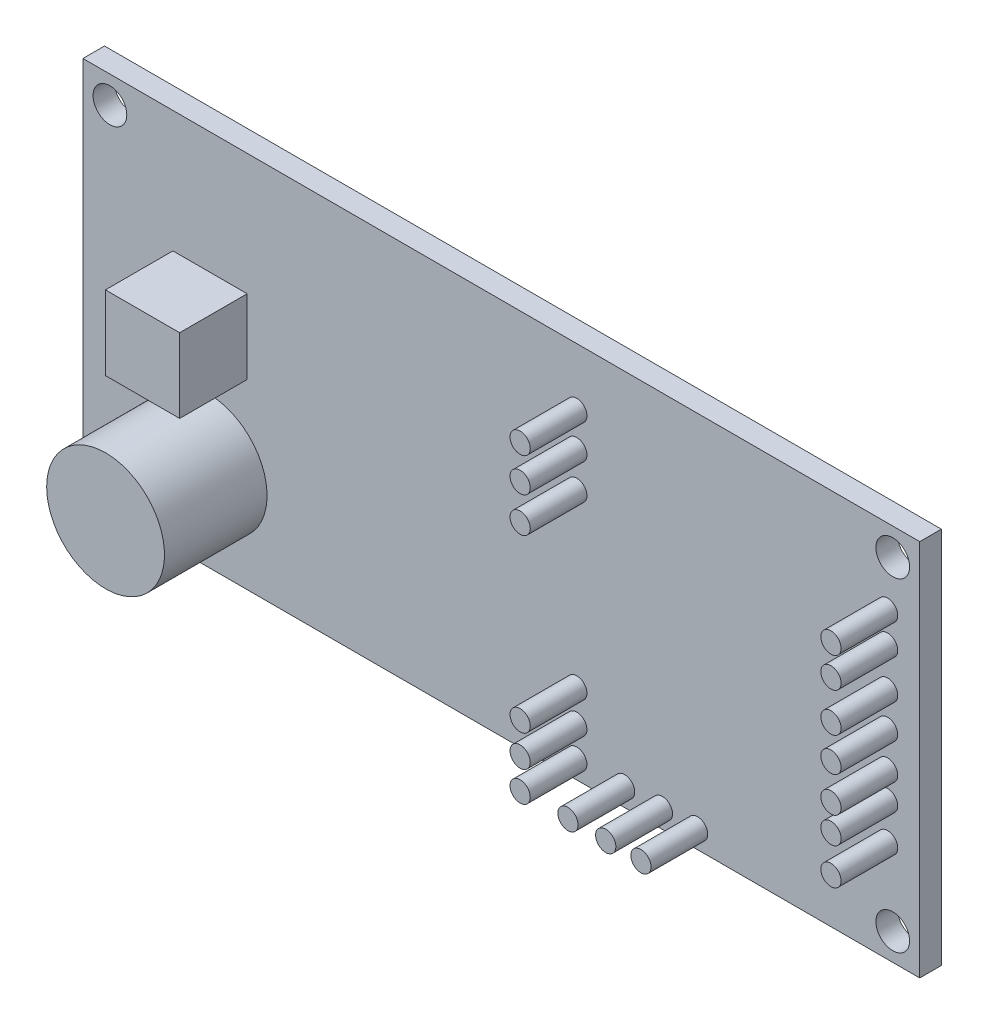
ISO-10303-21;
HEADER;
FILE_DESCRIPTION(('STEP AP214'),'2;1');
FILE_NAME('part.step','',(''),(''),'','','');
FILE_SCHEMA(('AUTOMOTIVE_DESIGN { 1 0 10303 214 1 1 1 1 }'));
ENDSEC;
DATA;
#1=APPLICATION_CONTEXT('core data for automotive mechanical design processes');
#2=APPLICATION_PROTOCOL_DEFINITION('international standard','automotive_design',2000,#1);
#3=PRODUCT_CONTEXT('',#1,'mechanical');
#4=PRODUCT('Part','Part','',(#3));
#5=PRODUCT_RELATED_PRODUCT_CATEGORY('part','',(#4));
#6=PRODUCT_DEFINITION_FORMATION('','',#4);
#7=PRODUCT_DEFINITION_CONTEXT('part definition',#1,'design');
#8=PRODUCT_DEFINITION('design','',#6,#7);
#9=PRODUCT_DEFINITION_SHAPE('','',#8);
#10=(LENGTH_UNIT() NAMED_UNIT(*) SI_UNIT(.MILLI.,.METRE.));
#11=(NAMED_UNIT(*) PLANE_ANGLE_UNIT() SI_UNIT($,.RADIAN.));
#12=(NAMED_UNIT(*) SI_UNIT($,.STERADIAN.) SOLID_ANGLE_UNIT());
#13=UNCERTAINTY_MEASURE_WITH_UNIT(LENGTH_MEASURE(1.E-05),#10,'distance_accuracy_value','');
#14=(GEOMETRIC_REPRESENTATION_CONTEXT(3) GLOBAL_UNCERTAINTY_ASSIGNED_CONTEXT((#13)) GLOBAL_UNIT_ASSIGNED_CONTEXT((#10,
#11,#12)) REPRESENTATION_CONTEXT('',''));
#15=CARTESIAN_POINT('',(0.,0.,0.));
#16=DIRECTION('',(0.,0.,1.));
#17=DIRECTION('',(1.,0.,0.));
#18=AXIS2_PLACEMENT_3D('',#15,#16,#17);
#19=CARTESIAN_POINT('',(0.,28.,-0.8));
#20=DIRECTION('',(0.,0.,-1.));
#21=DIRECTION('',(-1.,0.,0.));
#22=AXIS2_PLACEMENT_3D('',#19,#20,#21);
#23=PLANE('',#22);
#24=DIRECTION('',(-1.,0.,0.));
#25=VECTOR('',#24,1.);
#26=CARTESIAN_POINT('',(19.6263687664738,1.64749066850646,-0.8));
#27=LINE('',#26,#25);
#28=CARTESIAN_POINT('',(19.6263687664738,1.64749066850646,-0.8));
#29=VERTEX_POINT('',#28);
#30=CARTESIAN_POINT('',(15.4311769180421,1.64749066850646,-0.8));
#31=VERTEX_POINT('',#30);
#32=EDGE_CURVE('E182',#29,#31,#27,.T.);
#33=ORIENTED_EDGE('',*,*,#32,.F.);
#34=DIRECTION('',(0.,-1.,0.));
#35=VECTOR('',#34,1.);
#36=CARTESIAN_POINT('',(19.6263687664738,5.283323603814,-0.8));
#37=LINE('',#36,#35);
#38=CARTESIAN_POINT('',(19.6263687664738,5.283323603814,-0.8));
#39=VERTEX_POINT('',#38);
#40=EDGE_CURVE('E151',#39,#29,#37,.T.);
#41=ORIENTED_EDGE('',*,*,#40,.F.);
#42=DIRECTION('',(1.,0.,0.));
#43=VECTOR('',#42,1.);
#44=CARTESIAN_POINT('',(19.6263687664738,5.283323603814,-0.8));
#45=LINE('',#44,#43);
#46=CARTESIAN_POINT('',(15.4311769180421,5.283323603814,-0.8));
#47=VERTEX_POINT('',#46);
#48=EDGE_CURVE('E186',#47,#39,#45,.T.);
#49=ORIENTED_EDGE('',*,*,#48,.F.);
#50=DIRECTION('',(0.,1.,0.));
#51=VECTOR('',#50,1.);
#52=CARTESIAN_POINT('',(15.4311769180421,5.283323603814,-0.8));
#53=LINE('',#52,#51);
#54=EDGE_CURVE('E184',#31,#47,#53,.T.);
#55=ORIENTED_EDGE('',*,*,#54,.F.);
#56=EDGE_LOOP('',(#33,#41,#49,#55));
#57=FACE_BOUND('',#56,.T.);
#58=CARTESIAN_POINT('',(60.,2.,-0.8));
#59=DIRECTION('',(0.,0.,1.));
#60=DIRECTION('',(1.,0.,0.));
#61=AXIS2_PLACEMENT_3D('',#58,#59,#60);
#62=CIRCLE('',#61,1.25);
#63=CARTESIAN_POINT('',(61.25,2.,-0.8));
#64=VERTEX_POINT('',#63);
#65=EDGE_CURVE('E296',#64,#64,#62,.T.);
#66=ORIENTED_EDGE('',*,*,#65,.T.);
#67=EDGE_LOOP('',(#66));
#68=FACE_BOUND('',#67,.T.);
#69=CARTESIAN_POINT('',(2.,2.,-0.8));
#70=DIRECTION('',(0.,0.,1.));
#71=DIRECTION('',(1.,0.,0.));
#72=AXIS2_PLACEMENT_3D('',#69,#70,#71);
#73=CIRCLE('',#72,1.25);
#74=CARTESIAN_POINT('',(3.25,2.,-0.8));
#75=VERTEX_POINT('',#74);
#76=EDGE_CURVE('E308',#75,#75,#73,.T.);
#77=ORIENTED_EDGE('',*,*,#76,.T.);
#78=EDGE_LOOP('',(#77));
#79=FACE_BOUND('',#78,.T.);
#80=DIRECTION('',(0.,-1.,0.));
#81=VECTOR('',#80,1.);
#82=CARTESIAN_POINT('',(0.,0.,-0.8));
#83=LINE('',#82,#81);
#84=CARTESIAN_POINT('',(0.,28.,-0.8));
#85=VERTEX_POINT('',#84);
#86=CARTESIAN_POINT('',(0.,0.,-0.8));
#87=VERTEX_POINT('',#86);
#88=EDGE_CURVE('E314',#85,#87,#83,.T.);
#89=ORIENTED_EDGE('',*,*,#88,.F.);
#90=DIRECTION('',(-1.,0.,0.));
#91=VECTOR('',#90,1.);
#92=CARTESIAN_POINT('',(0.,28.,-0.8));
#93=LINE('',#92,#91);
#94=CARTESIAN_POINT('',(62.,28.,-0.8));
#95=VERTEX_POINT('',#94);
#96=EDGE_CURVE('E321',#95,#85,#93,.T.);
#97=ORIENTED_EDGE('',*,*,#96,.F.);
#98=DIRECTION('',(0.,1.,0.));
#99=VECTOR('',#98,1.);
#100=CARTESIAN_POINT('',(62.,0.,-0.8));
#101=LINE('',#100,#99);
#102=CARTESIAN_POINT('',(62.,0.,-0.8));
#103=VERTEX_POINT('',#102);
#104=EDGE_CURVE('E319',#103,#95,#101,.T.);
#105=ORIENTED_EDGE('',*,*,#104,.F.);
#106=DIRECTION('',(1.,0.,0.));
#107=VECTOR('',#106,1.);
#108=CARTESIAN_POINT('',(0.,0.,-0.8));
#109=LINE('',#108,#107);
#110=EDGE_CURVE('E317',#87,#103,#109,.T.);
#111=ORIENTED_EDGE('',*,*,#110,.F.);
#112=EDGE_LOOP('',(#89,#97,#105,#111));
#113=FACE_BOUND('',#112,.T.);
#114=CARTESIAN_POINT('',(60.,26.,-0.8));
#115=DIRECTION('',(0.,0.,1.));
#116=DIRECTION('',(1.,0.,0.));
#117=AXIS2_PLACEMENT_3D('',#114,#115,#116);
#118=CIRCLE('',#117,1.25);
#119=CARTESIAN_POINT('',(61.25,26.,-0.8));
#120=VERTEX_POINT('',#119);
#121=EDGE_CURVE('E302',#120,#120,#118,.T.);
#122=ORIENTED_EDGE('',*,*,#121,.T.);
#123=EDGE_LOOP('',(#122));
#124=FACE_BOUND('',#123,.T.);
#125=CARTESIAN_POINT('',(2.,26.,-0.8));
#126=DIRECTION('',(0.,0.,1.));
#127=DIRECTION('',(1.,0.,0.));
#128=AXIS2_PLACEMENT_3D('',#125,#126,#127);
#129=CIRCLE('',#128,1.25);
#130=CARTESIAN_POINT('',(3.25,26.,-0.8));
#131=VERTEX_POINT('',#130);
#132=EDGE_CURVE('E290',#131,#131,#129,.T.);
#133=ORIENTED_EDGE('',*,*,#132,.T.);
#134=EDGE_LOOP('',(#133));
#135=FACE_BOUND('',#134,.T.);
#136=DIRECTION('',(-1.,0.,0.));
#137=VECTOR('',#136,1.);
#138=CARTESIAN_POINT('',(26.9912611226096,1.64749066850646,-0.8));
#139=LINE('',#138,#137);
#140=CARTESIAN_POINT('',(26.9912611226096,1.64749066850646,-0.8));
#141=VERTEX_POINT('',#140);
#142=CARTESIAN_POINT('',(22.8892957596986,1.64749066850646,-0.8));
#143=VERTEX_POINT('',#142);
#144=EDGE_CURVE('E145',#141,#143,#139,.T.);
#145=ORIENTED_EDGE('',*,*,#144,.F.);
#146=DIRECTION('',(0.,-1.,0.));
#147=VECTOR('',#146,1.);
#148=CARTESIAN_POINT('',(26.9912611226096,5.283323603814,-0.8));
#149=LINE('',#148,#147);
#150=CARTESIAN_POINT('',(26.9912611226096,5.283323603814,-0.8));
#151=VERTEX_POINT('',#150);
#152=EDGE_CURVE('E156',#151,#141,#149,.T.);
#153=ORIENTED_EDGE('',*,*,#152,.F.);
#154=DIRECTION('',(1.,0.,0.));
#155=VECTOR('',#154,1.);
#156=CARTESIAN_POINT('',(26.9912611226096,5.283323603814,-0.8));
#157=LINE('',#156,#155);
#158=CARTESIAN_POINT('',(22.8892957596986,5.283323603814,-0.8));
#159=VERTEX_POINT('',#158);
#160=EDGE_CURVE('E166',#159,#151,#157,.T.);
#161=ORIENTED_EDGE('',*,*,#160,.F.);
#162=DIRECTION('',(0.,1.,0.));
#163=VECTOR('',#162,1.);
#164=CARTESIAN_POINT('',(22.8892957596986,5.283323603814,-0.8));
#165=LINE('',#164,#163);
#166=EDGE_CURVE('E164',#143,#159,#165,.T.);
#167=ORIENTED_EDGE('',*,*,#166,.F.);
#168=EDGE_LOOP('',(#145,#153,#161,#167));
#169=FACE_BOUND('',#168,.T.);
#170=ADVANCED_FACE('F26',(#57,#68,#79,#113,#124,#135,#169),#23,.T.);
#171=CARTESIAN_POINT('',(0.,28.,0.8));
#172=DIRECTION('',(0.,0.,-1.));
#173=DIRECTION('',(-1.,0.,0.));
#174=AXIS2_PLACEMENT_3D('',#171,#172,#173);
#175=PLANE('',#174);
#176=CARTESIAN_POINT('',(9.27822887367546,6.77494737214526,0.8));
#177=DIRECTION('',(0.,0.,-1.));
#178=DIRECTION('',(-1.,0.,0.));
#179=AXIS2_PLACEMENT_3D('',#176,#177,#178);
#180=CIRCLE('',#179,4.36475214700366);
#181=CARTESIAN_POINT('',(4.9134767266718,6.77494737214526,0.800000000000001));
#182=VERTEX_POINT('',#181);
#183=EDGE_CURVE('E11',#182,#182,#180,.F.);
#184=ORIENTED_EDGE('',*,*,#183,.F.);
#185=EDGE_LOOP('',(#184));
#186=FACE_BOUND('',#185,.T.);
#187=CARTESIAN_POINT('',(40.1361955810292,1.36781121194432,0.8));
#188=DIRECTION('',(0.,0.,-1.));
#189=DIRECTION('',(-1.,0.,0.));
#190=AXIS2_PLACEMENT_3D('',#187,#188,#189);
#191=CIRCLE('',#190,0.749999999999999);
#192=CARTESIAN_POINT('',(39.3861955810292,1.36781121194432,0.8));
#193=VERTEX_POINT('',#192);
#194=EDGE_CURVE('E386',#193,#193,#191,.F.);
#195=ORIENTED_EDGE('',*,*,#194,.F.);
#196=EDGE_LOOP('',(#195));
#197=FACE_BOUND('',#196,.T.);
#198=CARTESIAN_POINT('',(36.5935891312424,1.36781121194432,0.8));
#199=DIRECTION('',(0.,0.,-1.));
#200=DIRECTION('',(-1.,0.,0.));
#201=AXIS2_PLACEMENT_3D('',#198,#199,#200);
#202=CIRCLE('',#201,0.749999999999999);
#203=CARTESIAN_POINT('',(35.8435891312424,1.36781121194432,0.8));
#204=VERTEX_POINT('',#203);
#205=EDGE_CURVE('E380',#204,#204,#202,.F.);
#206=ORIENTED_EDGE('',*,*,#205,.F.);
#207=EDGE_LOOP('',(#206));
#208=FACE_BOUND('',#207,.T.);
#209=CARTESIAN_POINT('',(36.5935891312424,5.93590900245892,0.8));
#210=DIRECTION('',(0.,0.,-1.));
#211=DIRECTION('',(-1.,0.,0.));
#212=AXIS2_PLACEMENT_3D('',#209,#210,#211);
#213=CIRCLE('',#212,0.749999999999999);
#214=CARTESIAN_POINT('',(35.8435891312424,5.93590900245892,0.8));
#215=VERTEX_POINT('',#214);
#216=EDGE_CURVE('E374',#215,#215,#213,.F.);
#217=ORIENTED_EDGE('',*,*,#216,.F.);
#218=EDGE_LOOP('',(#217));
#219=FACE_BOUND('',#218,.T.);
#220=CARTESIAN_POINT('',(36.5935891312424,23.7421677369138,0.8));
#221=DIRECTION('',(0.,0.,-1.));
#222=DIRECTION('',(-1.,0.,0.));
#223=AXIS2_PLACEMENT_3D('',#220,#221,#222);
#224=CIRCLE('',#223,0.749999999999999);
#225=CARTESIAN_POINT('',(35.8435891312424,23.7421677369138,0.8));
#226=VERTEX_POINT('',#225);
#227=EDGE_CURVE('E368',#226,#226,#224,.F.);
#228=ORIENTED_EDGE('',*,*,#227,.F.);
#229=EDGE_LOOP('',(#228));
#230=FACE_BOUND('',#229,.T.);
#231=CARTESIAN_POINT('',(59.6205310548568,7.52075925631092,0.8));
#232=DIRECTION('',(0.,0.,-1.));
#233=DIRECTION('',(-1.,0.,0.));
#234=AXIS2_PLACEMENT_3D('',#231,#232,#233);
#235=CIRCLE('',#234,0.749999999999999);
#236=CARTESIAN_POINT('',(58.8705310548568,7.52075925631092,0.8));
#237=VERTEX_POINT('',#236);
#238=EDGE_CURVE('E362',#237,#237,#235,.F.);
#239=ORIENTED_EDGE('',*,*,#238,.F.);
#240=EDGE_LOOP('',(#239));
#241=FACE_BOUND('',#240,.T.);
#242=CARTESIAN_POINT('',(59.6205310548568,12.1820835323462,0.8));
#243=DIRECTION('',(0.,0.,-1.));
#244=DIRECTION('',(-1.,0.,0.));
#245=AXIS2_PLACEMENT_3D('',#242,#243,#244);
#246=CIRCLE('',#245,0.749999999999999);
#247=CARTESIAN_POINT('',(58.8705310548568,12.1820835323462,0.8));
#248=VERTEX_POINT('',#247);
#249=EDGE_CURVE('E356',#248,#248,#246,.F.);
#250=ORIENTED_EDGE('',*,*,#249,.F.);
#251=EDGE_LOOP('',(#250));
#252=FACE_BOUND('',#251,.T.);
#253=CARTESIAN_POINT('',(59.6205310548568,17.3095402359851,0.8));
#254=DIRECTION('',(0.,0.,-1.));
#255=DIRECTION('',(-1.,0.,0.));
#256=AXIS2_PLACEMENT_3D('',#253,#254,#255);
#257=CIRCLE('',#256,0.749999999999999);
#258=CARTESIAN_POINT('',(58.8705310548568,17.3095402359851,0.8));
#259=VERTEX_POINT('',#258);
#260=EDGE_CURVE('E350',#259,#259,#257,.F.);
#261=ORIENTED_EDGE('',*,*,#260,.F.);
#262=EDGE_LOOP('',(#261));
#263=FACE_BOUND('',#262,.T.);
#264=CARTESIAN_POINT('',(59.6205310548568,22.4369969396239,0.8));
#265=DIRECTION('',(0.,0.,-1.));
#266=DIRECTION('',(-1.,0.,0.));
#267=AXIS2_PLACEMENT_3D('',#264,#265,#266);
#268=CIRCLE('',#267,0.749999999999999);
#269=CARTESIAN_POINT('',(58.8705310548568,22.4369969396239,0.8));
#270=VERTEX_POINT('',#269);
#271=EDGE_CURVE('E344',#270,#270,#268,.F.);
#272=ORIENTED_EDGE('',*,*,#271,.F.);
#273=EDGE_LOOP('',(#272));
#274=FACE_BOUND('',#273,.T.);
#275=CARTESIAN_POINT('',(60.,2.,0.8));
#276=DIRECTION('',(0.,0.,1.));
#277=DIRECTION('',(1.,0.,0.));
#278=AXIS2_PLACEMENT_3D('',#275,#276,#277);
#279=CIRCLE('',#278,1.25);
#280=CARTESIAN_POINT('',(61.25,2.,0.8));
#281=VERTEX_POINT('',#280);
#282=EDGE_CURVE('E299',#281,#281,#279,.T.);
#283=ORIENTED_EDGE('',*,*,#282,.F.);
#284=EDGE_LOOP('',(#283));
#285=FACE_BOUND('',#284,.T.);
#286=CARTESIAN_POINT('',(2.,2.,0.8));
#287=DIRECTION('',(0.,0.,1.));
#288=DIRECTION('',(1.,0.,0.));
#289=AXIS2_PLACEMENT_3D('',#286,#287,#288);
#290=CIRCLE('',#289,1.25);
#291=CARTESIAN_POINT('',(3.25,2.,0.8));
#292=VERTEX_POINT('',#291);
#293=EDGE_CURVE('E311',#292,#292,#290,.T.);
#294=ORIENTED_EDGE('',*,*,#293,.F.);
#295=EDGE_LOOP('',(#294));
#296=FACE_BOUND('',#295,.T.);
#297=DIRECTION('',(0.,-1.,0.));
#298=VECTOR('',#297,1.);
#299=CARTESIAN_POINT('',(0.,0.,0.8));
#300=LINE('',#299,#298);
#301=CARTESIAN_POINT('',(0.,28.,0.8));
#302=VERTEX_POINT('',#301);
#303=CARTESIAN_POINT('',(0.,0.,0.8));
#304=VERTEX_POINT('',#303);
#305=EDGE_CURVE('E323',#302,#304,#300,.T.);
#306=ORIENTED_EDGE('',*,*,#305,.T.);
#307=DIRECTION('',(1.,0.,0.));
#308=VECTOR('',#307,1.);
#309=CARTESIAN_POINT('',(0.,0.,0.8));
#310=LINE('',#309,#308);
#311=CARTESIAN_POINT('',(62.,0.,0.8));
#312=VERTEX_POINT('',#311);
#313=EDGE_CURVE('E326',#304,#312,#310,.T.);
#314=ORIENTED_EDGE('',*,*,#313,.T.);
#315=DIRECTION('',(0.,1.,0.));
#316=VECTOR('',#315,1.);
#317=CARTESIAN_POINT('',(62.,0.,0.8));
#318=LINE('',#317,#316);
#319=CARTESIAN_POINT('',(62.,28.,0.8));
#320=VERTEX_POINT('',#319);
#321=EDGE_CURVE('E328',#312,#320,#318,.T.);
#322=ORIENTED_EDGE('',*,*,#321,.T.);
#323=DIRECTION('',(-1.,0.,0.));
#324=VECTOR('',#323,1.);
#325=CARTESIAN_POINT('',(0.,28.,0.8));
#326=LINE('',#325,#324);
#327=EDGE_CURVE('E330',#320,#302,#326,.T.);
#328=ORIENTED_EDGE('',*,*,#327,.T.);
#329=EDGE_LOOP('',(#306,#314,#322,#328));
#330=FACE_BOUND('',#329,.T.);
#331=CARTESIAN_POINT('',(60.,26.,0.8));
#332=DIRECTION('',(0.,0.,1.));
#333=DIRECTION('',(1.,0.,0.));
#334=AXIS2_PLACEMENT_3D('',#331,#332,#333);
#335=CIRCLE('',#334,1.25);
#336=CARTESIAN_POINT('',(61.25,26.,0.8));
#337=VERTEX_POINT('',#336);
#338=EDGE_CURVE('E305',#337,#337,#335,.T.);
#339=ORIENTED_EDGE('',*,*,#338,.F.);
#340=EDGE_LOOP('',(#339));
#341=FACE_BOUND('',#340,.T.);
#342=CARTESIAN_POINT('',(2.,26.,0.8));
#343=DIRECTION('',(0.,0.,1.));
#344=DIRECTION('',(1.,0.,0.));
#345=AXIS2_PLACEMENT_3D('',#342,#343,#344);
#346=CIRCLE('',#345,1.25);
#347=CARTESIAN_POINT('',(3.25,26.,0.8));
#348=VERTEX_POINT('',#347);
#349=EDGE_CURVE('E293',#348,#348,#346,.T.);
#350=ORIENTED_EDGE('',*,*,#349,.F.);
#351=EDGE_LOOP('',(#350));
#352=FACE_BOUND('',#351,.T.);
#353=CARTESIAN_POINT('',(59.6205310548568,20.199561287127,0.8));
#354=DIRECTION('',(0.,0.,-1.));
#355=DIRECTION('',(-1.,0.,0.));
#356=AXIS2_PLACEMENT_3D('',#353,#354,#355);
#357=CIRCLE('',#356,0.749999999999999);
#358=CARTESIAN_POINT('',(58.8705310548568,20.199561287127,0.8));
#359=VERTEX_POINT('',#358);
#360=EDGE_CURVE('E347',#359,#359,#357,.F.);
#361=ORIENTED_EDGE('',*,*,#360,.F.);
#362=EDGE_LOOP('',(#361));
#363=FACE_BOUND('',#362,.T.);
#364=CARTESIAN_POINT('',(59.6205310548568,14.792425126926,0.8));
#365=DIRECTION('',(0.,0.,-1.));
#366=DIRECTION('',(-1.,0.,0.));
#367=AXIS2_PLACEMENT_3D('',#364,#365,#366);
#368=CIRCLE('',#367,0.749999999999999);
#369=CARTESIAN_POINT('',(58.8705310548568,14.792425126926,0.8));
#370=VERTEX_POINT('',#369);
#371=EDGE_CURVE('E353',#370,#370,#368,.F.);
#372=ORIENTED_EDGE('',*,*,#371,.F.);
#373=EDGE_LOOP('',(#372));
#374=FACE_BOUND('',#373,.T.);
#375=CARTESIAN_POINT('',(59.6205310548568,10.2243273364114,0.8));
#376=DIRECTION('',(0.,0.,-1.));
#377=DIRECTION('',(-1.,0.,0.));
#378=AXIS2_PLACEMENT_3D('',#375,#376,#377);
#379=CIRCLE('',#378,0.749999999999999);
#380=CARTESIAN_POINT('',(58.8705310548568,10.2243273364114,0.8));
#381=VERTEX_POINT('',#380);
#382=EDGE_CURVE('E359',#381,#381,#379,.F.);
#383=ORIENTED_EDGE('',*,*,#382,.F.);
#384=EDGE_LOOP('',(#383));
#385=FACE_BOUND('',#384,.T.);
#386=CARTESIAN_POINT('',(36.5935891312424,21.2250526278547,0.8));
#387=DIRECTION('',(0.,0.,-1.));
#388=DIRECTION('',(-1.,0.,0.));
#389=AXIS2_PLACEMENT_3D('',#386,#387,#388);
#390=CIRCLE('',#389,0.749999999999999);
#391=CARTESIAN_POINT('',(35.8435891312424,21.2250526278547,0.8));
#392=VERTEX_POINT('',#391);
#393=EDGE_CURVE('E365',#392,#392,#390,.F.);
#394=ORIENTED_EDGE('',*,*,#393,.F.);
#395=EDGE_LOOP('',(#394));
#396=FACE_BOUND('',#395,.T.);
#397=CARTESIAN_POINT('',(36.5935891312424,18.614711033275,0.8));
#398=DIRECTION('',(0.,0.,-1.));
#399=DIRECTION('',(-1.,0.,0.));
#400=AXIS2_PLACEMENT_3D('',#397,#398,#399);
#401=CIRCLE('',#400,0.749999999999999);
#402=CARTESIAN_POINT('',(35.8435891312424,18.614711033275,0.8));
#403=VERTEX_POINT('',#402);
#404=EDGE_CURVE('E371',#403,#403,#401,.F.);
#405=ORIENTED_EDGE('',*,*,#404,.F.);
#406=EDGE_LOOP('',(#405));
#407=FACE_BOUND('',#406,.T.);
#408=CARTESIAN_POINT('',(36.5935891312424,3.60524686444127,0.8));
#409=DIRECTION('',(0.,0.,-1.));
#410=DIRECTION('',(-1.,0.,0.));
#411=AXIS2_PLACEMENT_3D('',#408,#409,#410);
#412=CIRCLE('',#411,0.749999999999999);
#413=CARTESIAN_POINT('',(35.8435891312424,3.60524686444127,0.8));
#414=VERTEX_POINT('',#413);
#415=EDGE_CURVE('E377',#414,#414,#412,.F.);
#416=ORIENTED_EDGE('',*,*,#415,.F.);
#417=EDGE_LOOP('',(#416));
#418=FACE_BOUND('',#417,.T.);
#419=CARTESIAN_POINT('',(42.9329901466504,1.36781121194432,0.8));
#420=DIRECTION('',(0.,0.,-1.));
#421=DIRECTION('',(-1.,0.,0.));
#422=AXIS2_PLACEMENT_3D('',#419,#420,#421);
#423=CIRCLE('',#422,0.749999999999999);
#424=CARTESIAN_POINT('',(42.1829901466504,1.36781121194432,0.8));
#425=VERTEX_POINT('',#424);
#426=EDGE_CURVE('E383',#425,#425,#423,.F.);
#427=ORIENTED_EDGE('',*,*,#426,.F.);
#428=EDGE_LOOP('',(#427));
#429=FACE_BOUND('',#428,.T.);
#430=CARTESIAN_POINT('',(45.5433317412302,1.36781121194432,0.8));
#431=DIRECTION('',(0.,0.,-1.));
#432=DIRECTION('',(-1.,0.,0.));
#433=AXIS2_PLACEMENT_3D('',#430,#431,#432);
#434=CIRCLE('',#433,0.749999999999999);
#435=CARTESIAN_POINT('',(44.7933317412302,1.36781121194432,0.8));
#436=VERTEX_POINT('',#435);
#437=EDGE_CURVE('E34',#436,#436,#434,.F.);
#438=ORIENTED_EDGE('',*,*,#437,.F.);
#439=EDGE_LOOP('',(#438));
#440=FACE_BOUND('',#439,.T.);
#441=DIRECTION('',(0.,-1.,0.));
#442=VECTOR('',#441,1.);
#443=CARTESIAN_POINT('',(6.66788727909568,18.9876169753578,0.8));
#444=LINE('',#443,#442);
#445=CARTESIAN_POINT('',(6.66788727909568,18.9876169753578,0.8));
#446=VERTEX_POINT('',#445);
#447=CARTESIAN_POINT('',(6.66788727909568,13.4872543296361,0.8));
#448=VERTEX_POINT('',#447);
#449=EDGE_CURVE('E206',#446,#448,#444,.T.);
#450=ORIENTED_EDGE('',*,*,#449,.F.);
#451=DIRECTION('',(-1.,0.,0.));
#452=VECTOR('',#451,1.);
#453=CARTESIAN_POINT('',(6.66788727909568,18.9876169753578,0.8));
#454=LINE('',#453,#452);
#455=CARTESIAN_POINT('',(12.1682499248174,18.9876169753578,0.8));
#456=VERTEX_POINT('',#455);
#457=EDGE_CURVE('E215',#456,#446,#454,.T.);
#458=ORIENTED_EDGE('',*,*,#457,.F.);
#459=DIRECTION('',(0.,1.,0.));
#460=VECTOR('',#459,1.);
#461=CARTESIAN_POINT('',(12.1682499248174,18.9876169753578,0.8));
#462=LINE('',#461,#460);
#463=CARTESIAN_POINT('',(12.1682499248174,13.4872543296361,0.8));
#464=VERTEX_POINT('',#463);
#465=EDGE_CURVE('E212',#464,#456,#462,.T.);
#466=ORIENTED_EDGE('',*,*,#465,.F.);
#467=DIRECTION('',(1.,0.,0.));
#468=VECTOR('',#467,1.);
#469=CARTESIAN_POINT('',(6.66788727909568,13.4872543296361,0.8));
#470=LINE('',#469,#468);
#471=EDGE_CURVE('E209',#448,#464,#470,.T.);
#472=ORIENTED_EDGE('',*,*,#471,.F.);
#473=EDGE_LOOP('',(#450,#458,#466,#472));
#474=FACE_BOUND('',#473,.T.);
#475=ADVANCED_FACE('F393',(#186,#197,#208,#219,#230,#241,#252,#263,#274,#285,#296,#330,#341,
#352,#363,#374,#385,#396,#407,#418,#429,#440,#474),#175,.F.);
#476=CARTESIAN_POINT('',(0.,0.,0.8));
#477=DIRECTION('',(1.,0.,0.));
#478=DIRECTION('',(0.,0.,-1.));
#479=AXIS2_PLACEMENT_3D('',#476,#477,#478);
#480=PLANE('',#479);
#481=ORIENTED_EDGE('',*,*,#88,.T.);
#482=DIRECTION('',(0.,0.,-1.));
#483=VECTOR('',#482,1.);
#484=CARTESIAN_POINT('',(0.,0.,0.8));
#485=LINE('',#484,#483);
#486=EDGE_CURVE('E341',#304,#87,#485,.T.);
#487=ORIENTED_EDGE('',*,*,#486,.F.);
#488=ORIENTED_EDGE('',*,*,#305,.F.);
#489=DIRECTION('',(0.,0.,-1.));
#490=VECTOR('',#489,1.);
#491=CARTESIAN_POINT('',(0.,28.,0.8));
#492=LINE('',#491,#490);
#493=EDGE_CURVE('E332',#302,#85,#492,.T.);
#494=ORIENTED_EDGE('',*,*,#493,.T.);
#495=EDGE_LOOP('',(#481,#487,#488,#494));
#496=FACE_BOUND('',#495,.T.);
#497=ADVANCED_FACE('F28',(#496),#480,.F.);
#498=CARTESIAN_POINT('',(0.,0.,0.8));
#499=DIRECTION('',(0.,1.,0.));
#500=DIRECTION('',(0.,0.,1.));
#501=AXIS2_PLACEMENT_3D('',#498,#499,#500);
#502=PLANE('',#501);
#503=ORIENTED_EDGE('',*,*,#110,.T.);
#504=DIRECTION('',(0.,0.,-1.));
#505=VECTOR('',#504,1.);
#506=CARTESIAN_POINT('',(62.,0.,0.8));
#507=LINE('',#506,#505);
#508=EDGE_CURVE('E338',#312,#103,#507,.T.);
#509=ORIENTED_EDGE('',*,*,#508,.F.);
#510=ORIENTED_EDGE('',*,*,#313,.F.);
#511=ORIENTED_EDGE('',*,*,#486,.T.);
#512=EDGE_LOOP('',(#503,#509,#510,#511));
#513=FACE_BOUND('',#512,.T.);
#514=ADVANCED_FACE('F443',(#513),#502,.F.);
#515=CARTESIAN_POINT('',(62.,0.,0.8));
#516=DIRECTION('',(-1.,0.,0.));
#517=DIRECTION('',(0.,0.,1.));
#518=AXIS2_PLACEMENT_3D('',#515,#516,#517);
#519=PLANE('',#518);
#520=ORIENTED_EDGE('',*,*,#104,.T.);
#521=DIRECTION('',(0.,0.,-1.));
#522=VECTOR('',#521,1.);
#523=CARTESIAN_POINT('',(62.,28.,0.8));
#524=LINE('',#523,#522);
#525=EDGE_CURVE('E335',#320,#95,#524,.T.);
#526=ORIENTED_EDGE('',*,*,#525,.F.);
#527=ORIENTED_EDGE('',*,*,#321,.F.);
#528=ORIENTED_EDGE('',*,*,#508,.T.);
#529=EDGE_LOOP('',(#520,#526,#527,#528));
#530=FACE_BOUND('',#529,.T.);
#531=ADVANCED_FACE('F440',(#530),#519,.F.);
#532=CARTESIAN_POINT('',(0.,28.,0.8));
#533=DIRECTION('',(0.,-1.,0.));
#534=DIRECTION('',(0.,0.,-1.));
#535=AXIS2_PLACEMENT_3D('',#532,#533,#534);
#536=PLANE('',#535);
#537=ORIENTED_EDGE('',*,*,#96,.T.);
#538=ORIENTED_EDGE('',*,*,#493,.F.);
#539=ORIENTED_EDGE('',*,*,#327,.F.);
#540=ORIENTED_EDGE('',*,*,#525,.T.);
#541=EDGE_LOOP('',(#537,#538,#539,#540));
#542=FACE_BOUND('',#541,.T.);
#543=ADVANCED_FACE('F437',(#542),#536,.F.);
#544=CARTESIAN_POINT('',(2.,2.,0.8));
#545=DIRECTION('',(0.,0.,-1.));
#546=DIRECTION('',(-1.,0.,0.));
#547=AXIS2_PLACEMENT_3D('',#544,#545,#546);
#548=CYLINDRICAL_SURFACE('',#547,1.25);
#549=ORIENTED_EDGE('',*,*,#293,.T.);
#550=EDGE_LOOP('',(#549));
#551=FACE_BOUND('',#550,.T.);
#552=ORIENTED_EDGE('',*,*,#76,.F.);
#553=EDGE_LOOP('',(#552));
#554=FACE_BOUND('',#553,.T.);
#555=ADVANCED_FACE('F434',(#551,#554),#548,.F.);
#556=CARTESIAN_POINT('',(60.,26.,0.8));
#557=DIRECTION('',(0.,0.,-1.));
#558=DIRECTION('',(-1.,0.,0.));
#559=AXIS2_PLACEMENT_3D('',#556,#557,#558);
#560=CYLINDRICAL_SURFACE('',#559,1.25);
#561=ORIENTED_EDGE('',*,*,#338,.T.);
#562=EDGE_LOOP('',(#561));
#563=FACE_BOUND('',#562,.T.);
#564=ORIENTED_EDGE('',*,*,#121,.F.);
#565=EDGE_LOOP('',(#564));
#566=FACE_BOUND('',#565,.T.);
#567=ADVANCED_FACE('F607',(#563,#566),#560,.F.);
#568=CARTESIAN_POINT('',(60.,2.,0.8));
#569=DIRECTION('',(0.,0.,-1.));
#570=DIRECTION('',(-1.,0.,0.));
#571=AXIS2_PLACEMENT_3D('',#568,#569,#570);
#572=CYLINDRICAL_SURFACE('',#571,1.25);
#573=ORIENTED_EDGE('',*,*,#282,.T.);
#574=EDGE_LOOP('',(#573));
#575=FACE_BOUND('',#574,.T.);
#576=ORIENTED_EDGE('',*,*,#65,.F.);
#577=EDGE_LOOP('',(#576));
#578=FACE_BOUND('',#577,.T.);
#579=ADVANCED_FACE('F604',(#575,#578),#572,.F.);
#580=CARTESIAN_POINT('',(2.,26.,0.8));
#581=DIRECTION('',(0.,0.,-1.));
#582=DIRECTION('',(-1.,0.,0.));
#583=AXIS2_PLACEMENT_3D('',#580,#581,#582);
#584=CYLINDRICAL_SURFACE('',#583,1.25);
#585=ORIENTED_EDGE('',*,*,#349,.T.);
#586=EDGE_LOOP('',(#585));
#587=FACE_BOUND('',#586,.T.);
#588=ORIENTED_EDGE('',*,*,#132,.F.);
#589=EDGE_LOOP('',(#588));
#590=FACE_BOUND('',#589,.T.);
#591=ADVANCED_FACE('F600',(#587,#590),#584,.F.);
#592=CARTESIAN_POINT('',(59.6205310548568,22.4369969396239,5.));
#593=DIRECTION('',(0.,0.,-1.));
#594=DIRECTION('',(-1.,0.,0.));
#595=AXIS2_PLACEMENT_3D('',#592,#593,#594);
#596=CYLINDRICAL_SURFACE('',#595,0.749999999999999);
#597=CARTESIAN_POINT('',(59.6205310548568,22.4369969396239,5.));
#598=DIRECTION('',(0.,0.,1.));
#599=DIRECTION('',(1.,0.,0.));
#600=AXIS2_PLACEMENT_3D('',#597,#598,#599);
#601=CIRCLE('',#600,0.749999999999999);
#602=CARTESIAN_POINT('',(60.3705310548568,22.4369969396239,5.));
#603=VERTEX_POINT('',#602);
#604=EDGE_CURVE('E287',#603,#603,#601,.T.);
#605=ORIENTED_EDGE('',*,*,#604,.F.);
#606=EDGE_LOOP('',(#605));
#607=FACE_BOUND('',#606,.T.);
#608=ORIENTED_EDGE('',*,*,#271,.T.);
#609=EDGE_LOOP('',(#608));
#610=FACE_BOUND('',#609,.T.);
#611=ADVANCED_FACE('F596',(#607,#610),#596,.T.);
#612=CARTESIAN_POINT('',(59.6205310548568,22.4369969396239,5.));
#613=DIRECTION('',(0.,0.,1.));
#614=DIRECTION('',(1.,0.,0.));
#615=AXIS2_PLACEMENT_3D('',#612,#613,#614);
#616=PLANE('',#615);
#617=ORIENTED_EDGE('',*,*,#604,.T.);
#618=EDGE_LOOP('',(#617));
#619=FACE_BOUND('',#618,.T.);
#620=ADVANCED_FACE('F592',(#619),#616,.T.);
#621=CARTESIAN_POINT('',(59.6205310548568,20.199561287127,5.));
#622=DIRECTION('',(0.,0.,-1.));
#623=DIRECTION('',(-1.,0.,0.));
#624=AXIS2_PLACEMENT_3D('',#621,#622,#623);
#625=CYLINDRICAL_SURFACE('',#624,0.749999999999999);
#626=CARTESIAN_POINT('',(59.6205310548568,20.199561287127,5.));
#627=DIRECTION('',(0.,0.,1.));
#628=DIRECTION('',(1.,0.,0.));
#629=AXIS2_PLACEMENT_3D('',#626,#627,#628);
#630=CIRCLE('',#629,0.749999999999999);
#631=CARTESIAN_POINT('',(60.3705310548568,20.199561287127,5.));
#632=VERTEX_POINT('',#631);
#633=EDGE_CURVE('E284',#632,#632,#630,.T.);
#634=ORIENTED_EDGE('',*,*,#633,.F.);
#635=EDGE_LOOP('',(#634));
#636=FACE_BOUND('',#635,.T.);
#637=ORIENTED_EDGE('',*,*,#360,.T.);
#638=EDGE_LOOP('',(#637));
#639=FACE_BOUND('',#638,.T.);
#640=ADVANCED_FACE('F588',(#636,#639),#625,.T.);
#641=CARTESIAN_POINT('',(59.6205310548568,20.199561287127,5.));
#642=DIRECTION('',(0.,0.,1.));
#643=DIRECTION('',(1.,0.,0.));
#644=AXIS2_PLACEMENT_3D('',#641,#642,#643);
#645=PLANE('',#644);
#646=ORIENTED_EDGE('',*,*,#633,.T.);
#647=EDGE_LOOP('',(#646));
#648=FACE_BOUND('',#647,.T.);
#649=ADVANCED_FACE('F584',(#648),#645,.T.);
#650=CARTESIAN_POINT('',(59.6205310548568,17.3095402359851,5.));
#651=DIRECTION('',(0.,0.,-1.));
#652=DIRECTION('',(-1.,0.,0.));
#653=AXIS2_PLACEMENT_3D('',#650,#651,#652);
#654=CYLINDRICAL_SURFACE('',#653,0.749999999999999);
#655=CARTESIAN_POINT('',(59.6205310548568,17.3095402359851,5.));
#656=DIRECTION('',(0.,0.,1.));
#657=DIRECTION('',(1.,0.,0.));
#658=AXIS2_PLACEMENT_3D('',#655,#656,#657);
#659=CIRCLE('',#658,0.749999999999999);
#660=CARTESIAN_POINT('',(60.3705310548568,17.3095402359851,5.));
#661=VERTEX_POINT('',#660);
#662=EDGE_CURVE('E281',#661,#661,#659,.T.);
#663=ORIENTED_EDGE('',*,*,#662,.F.);
#664=EDGE_LOOP('',(#663));
#665=FACE_BOUND('',#664,.T.);
#666=ORIENTED_EDGE('',*,*,#260,.T.);
#667=EDGE_LOOP('',(#666));
#668=FACE_BOUND('',#667,.T.);
#669=ADVANCED_FACE('F580',(#665,#668),#654,.T.);
#670=CARTESIAN_POINT('',(59.6205310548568,17.3095402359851,5.));
#671=DIRECTION('',(0.,0.,1.));
#672=DIRECTION('',(1.,0.,0.));
#673=AXIS2_PLACEMENT_3D('',#670,#671,#672);
#674=PLANE('',#673);
#675=ORIENTED_EDGE('',*,*,#662,.T.);
#676=EDGE_LOOP('',(#675));
#677=FACE_BOUND('',#676,.T.);
#678=ADVANCED_FACE('F576',(#677),#674,.T.);
#679=CARTESIAN_POINT('',(59.6205310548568,14.792425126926,5.));
#680=DIRECTION('',(0.,0.,-1.));
#681=DIRECTION('',(-1.,0.,0.));
#682=AXIS2_PLACEMENT_3D('',#679,#680,#681);
#683=CYLINDRICAL_SURFACE('',#682,0.749999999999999);
#684=CARTESIAN_POINT('',(59.6205310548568,14.792425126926,5.));
#685=DIRECTION('',(0.,0.,1.));
#686=DIRECTION('',(1.,0.,0.));
#687=AXIS2_PLACEMENT_3D('',#684,#685,#686);
#688=CIRCLE('',#687,0.749999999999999);
#689=CARTESIAN_POINT('',(60.3705310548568,14.792425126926,5.));
#690=VERTEX_POINT('',#689);
#691=EDGE_CURVE('E278',#690,#690,#688,.T.);
#692=ORIENTED_EDGE('',*,*,#691,.F.);
#693=EDGE_LOOP('',(#692));
#694=FACE_BOUND('',#693,.T.);
#695=ORIENTED_EDGE('',*,*,#371,.T.);
#696=EDGE_LOOP('',(#695));
#697=FACE_BOUND('',#696,.T.);
#698=ADVANCED_FACE('F572',(#694,#697),#683,.T.);
#699=CARTESIAN_POINT('',(59.6205310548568,14.792425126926,5.));
#700=DIRECTION('',(0.,0.,1.));
#701=DIRECTION('',(1.,0.,0.));
#702=AXIS2_PLACEMENT_3D('',#699,#700,#701);
#703=PLANE('',#702);
#704=ORIENTED_EDGE('',*,*,#691,.T.);
#705=EDGE_LOOP('',(#704));
#706=FACE_BOUND('',#705,.T.);
#707=ADVANCED_FACE('F568',(#706),#703,.T.);
#708=CARTESIAN_POINT('',(59.6205310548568,12.1820835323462,5.));
#709=DIRECTION('',(0.,0.,-1.));
#710=DIRECTION('',(-1.,0.,0.));
#711=AXIS2_PLACEMENT_3D('',#708,#709,#710);
#712=CYLINDRICAL_SURFACE('',#711,0.749999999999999);
#713=CARTESIAN_POINT('',(59.6205310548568,12.1820835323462,5.));
#714=DIRECTION('',(0.,0.,1.));
#715=DIRECTION('',(1.,0.,0.));
#716=AXIS2_PLACEMENT_3D('',#713,#714,#715);
#717=CIRCLE('',#716,0.749999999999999);
#718=CARTESIAN_POINT('',(60.3705310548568,12.1820835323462,5.));
#719=VERTEX_POINT('',#718);
#720=EDGE_CURVE('E275',#719,#719,#717,.T.);
#721=ORIENTED_EDGE('',*,*,#720,.F.);
#722=EDGE_LOOP('',(#721));
#723=FACE_BOUND('',#722,.T.);
#724=ORIENTED_EDGE('',*,*,#249,.T.);
#725=EDGE_LOOP('',(#724));
#726=FACE_BOUND('',#725,.T.);
#727=ADVANCED_FACE('F564',(#723,#726),#712,.T.);
#728=CARTESIAN_POINT('',(59.6205310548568,12.1820835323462,5.));
#729=DIRECTION('',(0.,0.,1.));
#730=DIRECTION('',(1.,0.,0.));
#731=AXIS2_PLACEMENT_3D('',#728,#729,#730);
#732=PLANE('',#731);
#733=ORIENTED_EDGE('',*,*,#720,.T.);
#734=EDGE_LOOP('',(#733));
#735=FACE_BOUND('',#734,.T.);
#736=ADVANCED_FACE('F560',(#735),#732,.T.);
#737=CARTESIAN_POINT('',(59.6205310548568,10.2243273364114,5.));
#738=DIRECTION('',(0.,0.,-1.));
#739=DIRECTION('',(-1.,0.,0.));
#740=AXIS2_PLACEMENT_3D('',#737,#738,#739);
#741=CYLINDRICAL_SURFACE('',#740,0.749999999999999);
#742=CARTESIAN_POINT('',(59.6205310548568,10.2243273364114,5.));
#743=DIRECTION('',(0.,0.,1.));
#744=DIRECTION('',(1.,0.,0.));
#745=AXIS2_PLACEMENT_3D('',#742,#743,#744);
#746=CIRCLE('',#745,0.749999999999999);
#747=CARTESIAN_POINT('',(60.3705310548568,10.2243273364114,5.));
#748=VERTEX_POINT('',#747);
#749=EDGE_CURVE('E272',#748,#748,#746,.T.);
#750=ORIENTED_EDGE('',*,*,#749,.F.);
#751=EDGE_LOOP('',(#750));
#752=FACE_BOUND('',#751,.T.);
#753=ORIENTED_EDGE('',*,*,#382,.T.);
#754=EDGE_LOOP('',(#753));
#755=FACE_BOUND('',#754,.T.);
#756=ADVANCED_FACE('F556',(#752,#755),#741,.T.);
#757=CARTESIAN_POINT('',(59.6205310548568,10.2243273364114,5.));
#758=DIRECTION('',(0.,0.,1.));
#759=DIRECTION('',(1.,0.,0.));
#760=AXIS2_PLACEMENT_3D('',#757,#758,#759);
#761=PLANE('',#760);
#762=ORIENTED_EDGE('',*,*,#749,.T.);
#763=EDGE_LOOP('',(#762));
#764=FACE_BOUND('',#763,.T.);
#765=ADVANCED_FACE('F552',(#764),#761,.T.);
#766=CARTESIAN_POINT('',(59.6205310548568,7.52075925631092,5.));
#767=DIRECTION('',(0.,0.,-1.));
#768=DIRECTION('',(-1.,0.,0.));
#769=AXIS2_PLACEMENT_3D('',#766,#767,#768);
#770=CYLINDRICAL_SURFACE('',#769,0.749999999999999);
#771=CARTESIAN_POINT('',(59.6205310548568,7.52075925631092,5.));
#772=DIRECTION('',(0.,0.,1.));
#773=DIRECTION('',(1.,0.,0.));
#774=AXIS2_PLACEMENT_3D('',#771,#772,#773);
#775=CIRCLE('',#774,0.749999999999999);
#776=CARTESIAN_POINT('',(60.3705310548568,7.52075925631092,5.));
#777=VERTEX_POINT('',#776);
#778=EDGE_CURVE('E269',#777,#777,#775,.T.);
#779=ORIENTED_EDGE('',*,*,#778,.F.);
#780=EDGE_LOOP('',(#779));
#781=FACE_BOUND('',#780,.T.);
#782=ORIENTED_EDGE('',*,*,#238,.T.);
#783=EDGE_LOOP('',(#782));
#784=FACE_BOUND('',#783,.T.);
#785=ADVANCED_FACE('F548',(#781,#784),#770,.T.);
#786=CARTESIAN_POINT('',(59.6205310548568,7.52075925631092,5.));
#787=DIRECTION('',(0.,0.,1.));
#788=DIRECTION('',(1.,0.,0.));
#789=AXIS2_PLACEMENT_3D('',#786,#787,#788);
#790=PLANE('',#789);
#791=ORIENTED_EDGE('',*,*,#778,.T.);
#792=EDGE_LOOP('',(#791));
#793=FACE_BOUND('',#792,.T.);
#794=ADVANCED_FACE('F544',(#793),#790,.T.);
#795=CARTESIAN_POINT('',(36.5935891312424,21.2250526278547,5.));
#796=DIRECTION('',(0.,0.,-1.));
#797=DIRECTION('',(-1.,0.,0.));
#798=AXIS2_PLACEMENT_3D('',#795,#796,#797);
#799=CYLINDRICAL_SURFACE('',#798,0.749999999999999);
#800=CARTESIAN_POINT('',(36.5935891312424,21.2250526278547,5.));
#801=DIRECTION('',(0.,0.,1.));
#802=DIRECTION('',(1.,0.,0.));
#803=AXIS2_PLACEMENT_3D('',#800,#801,#802);
#804=CIRCLE('',#803,0.749999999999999);
#805=CARTESIAN_POINT('',(37.3435891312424,21.2250526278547,5.));
#806=VERTEX_POINT('',#805);
#807=EDGE_CURVE('E266',#806,#806,#804,.T.);
#808=ORIENTED_EDGE('',*,*,#807,.F.);
#809=EDGE_LOOP('',(#808));
#810=FACE_BOUND('',#809,.T.);
#811=ORIENTED_EDGE('',*,*,#393,.T.);
#812=EDGE_LOOP('',(#811));
#813=FACE_BOUND('',#812,.T.);
#814=ADVANCED_FACE('F540',(#810,#813),#799,.T.);
#815=CARTESIAN_POINT('',(36.5935891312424,21.2250526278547,5.));
#816=DIRECTION('',(0.,0.,1.));
#817=DIRECTION('',(1.,0.,0.));
#818=AXIS2_PLACEMENT_3D('',#815,#816,#817);
#819=PLANE('',#818);
#820=ORIENTED_EDGE('',*,*,#807,.T.);
#821=EDGE_LOOP('',(#820));
#822=FACE_BOUND('',#821,.T.);
#823=ADVANCED_FACE('F536',(#822),#819,.T.);
#824=CARTESIAN_POINT('',(36.5935891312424,23.7421677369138,5.));
#825=DIRECTION('',(0.,0.,-1.));
#826=DIRECTION('',(-1.,0.,0.));
#827=AXIS2_PLACEMENT_3D('',#824,#825,#826);
#828=CYLINDRICAL_SURFACE('',#827,0.749999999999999);
#829=CARTESIAN_POINT('',(36.5935891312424,23.7421677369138,5.));
#830=DIRECTION('',(0.,0.,1.));
#831=DIRECTION('',(1.,0.,0.));
#832=AXIS2_PLACEMENT_3D('',#829,#830,#831);
#833=CIRCLE('',#832,0.749999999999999);
#834=CARTESIAN_POINT('',(37.3435891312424,23.7421677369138,5.));
#835=VERTEX_POINT('',#834);
#836=EDGE_CURVE('E263',#835,#835,#833,.T.);
#837=ORIENTED_EDGE('',*,*,#836,.F.);
#838=EDGE_LOOP('',(#837));
#839=FACE_BOUND('',#838,.T.);
#840=ORIENTED_EDGE('',*,*,#227,.T.);
#841=EDGE_LOOP('',(#840));
#842=FACE_BOUND('',#841,.T.);
#843=ADVANCED_FACE('F532',(#839,#842),#828,.T.);
#844=CARTESIAN_POINT('',(36.5935891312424,23.7421677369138,5.));
#845=DIRECTION('',(0.,0.,1.));
#846=DIRECTION('',(1.,0.,0.));
#847=AXIS2_PLACEMENT_3D('',#844,#845,#846);
#848=PLANE('',#847);
#849=ORIENTED_EDGE('',*,*,#836,.T.);
#850=EDGE_LOOP('',(#849));
#851=FACE_BOUND('',#850,.T.);
#852=ADVANCED_FACE('F528',(#851),#848,.T.);
#853=CARTESIAN_POINT('',(36.5935891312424,18.614711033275,5.));
#854=DIRECTION('',(0.,0.,-1.));
#855=DIRECTION('',(-1.,0.,0.));
#856=AXIS2_PLACEMENT_3D('',#853,#854,#855);
#857=CYLINDRICAL_SURFACE('',#856,0.749999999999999);
#858=CARTESIAN_POINT('',(36.5935891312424,18.614711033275,5.));
#859=DIRECTION('',(0.,0.,1.));
#860=DIRECTION('',(1.,0.,0.));
#861=AXIS2_PLACEMENT_3D('',#858,#859,#860);
#862=CIRCLE('',#861,0.749999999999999);
#863=CARTESIAN_POINT('',(37.3435891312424,18.614711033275,5.));
#864=VERTEX_POINT('',#863);
#865=EDGE_CURVE('E260',#864,#864,#862,.T.);
#866=ORIENTED_EDGE('',*,*,#865,.F.);
#867=EDGE_LOOP('',(#866));
#868=FACE_BOUND('',#867,.T.);
#869=ORIENTED_EDGE('',*,*,#404,.T.);
#870=EDGE_LOOP('',(#869));
#871=FACE_BOUND('',#870,.T.);
#872=ADVANCED_FACE('F524',(#868,#871),#857,.T.);
#873=CARTESIAN_POINT('',(36.5935891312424,18.614711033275,5.));
#874=DIRECTION('',(0.,0.,1.));
#875=DIRECTION('',(1.,0.,0.));
#876=AXIS2_PLACEMENT_3D('',#873,#874,#875);
#877=PLANE('',#876);
#878=ORIENTED_EDGE('',*,*,#865,.T.);
#879=EDGE_LOOP('',(#878));
#880=FACE_BOUND('',#879,.T.);
#881=ADVANCED_FACE('F520',(#880),#877,.T.);
#882=CARTESIAN_POINT('',(36.5935891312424,5.93590900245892,5.));
#883=DIRECTION('',(0.,0.,-1.));
#884=DIRECTION('',(-1.,0.,0.));
#885=AXIS2_PLACEMENT_3D('',#882,#883,#884);
#886=CYLINDRICAL_SURFACE('',#885,0.749999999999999);
#887=CARTESIAN_POINT('',(36.5935891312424,5.93590900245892,5.));
#888=DIRECTION('',(0.,0.,1.));
#889=DIRECTION('',(1.,0.,0.));
#890=AXIS2_PLACEMENT_3D('',#887,#888,#889);
#891=CIRCLE('',#890,0.749999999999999);
#892=CARTESIAN_POINT('',(37.3435891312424,5.93590900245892,5.));
#893=VERTEX_POINT('',#892);
#894=EDGE_CURVE('E257',#893,#893,#891,.T.);
#895=ORIENTED_EDGE('',*,*,#894,.F.);
#896=EDGE_LOOP('',(#895));
#897=FACE_BOUND('',#896,.T.);
#898=ORIENTED_EDGE('',*,*,#216,.T.);
#899=EDGE_LOOP('',(#898));
#900=FACE_BOUND('',#899,.T.);
#901=ADVANCED_FACE('F516',(#897,#900),#886,.T.);
#902=CARTESIAN_POINT('',(36.5935891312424,5.93590900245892,5.));
#903=DIRECTION('',(0.,0.,1.));
#904=DIRECTION('',(1.,0.,0.));
#905=AXIS2_PLACEMENT_3D('',#902,#903,#904);
#906=PLANE('',#905);
#907=ORIENTED_EDGE('',*,*,#894,.T.);
#908=EDGE_LOOP('',(#907));
#909=FACE_BOUND('',#908,.T.);
#910=ADVANCED_FACE('F512',(#909),#906,.T.);
#911=CARTESIAN_POINT('',(36.5935891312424,3.60524686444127,5.));
#912=DIRECTION('',(0.,0.,-1.));
#913=DIRECTION('',(-1.,0.,0.));
#914=AXIS2_PLACEMENT_3D('',#911,#912,#913);
#915=CYLINDRICAL_SURFACE('',#914,0.749999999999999);
#916=CARTESIAN_POINT('',(36.5935891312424,3.60524686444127,5.));
#917=DIRECTION('',(0.,0.,1.));
#918=DIRECTION('',(1.,0.,0.));
#919=AXIS2_PLACEMENT_3D('',#916,#917,#918);
#920=CIRCLE('',#919,0.749999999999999);
#921=CARTESIAN_POINT('',(37.3435891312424,3.60524686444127,5.));
#922=VERTEX_POINT('',#921);
#923=EDGE_CURVE('E254',#922,#922,#920,.T.);
#924=ORIENTED_EDGE('',*,*,#923,.F.);
#925=EDGE_LOOP('',(#924));
#926=FACE_BOUND('',#925,.T.);
#927=ORIENTED_EDGE('',*,*,#415,.T.);
#928=EDGE_LOOP('',(#927));
#929=FACE_BOUND('',#928,.T.);
#930=ADVANCED_FACE('F508',(#926,#929),#915,.T.);
#931=CARTESIAN_POINT('',(36.5935891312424,3.60524686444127,5.));
#932=DIRECTION('',(0.,0.,1.));
#933=DIRECTION('',(1.,0.,0.));
#934=AXIS2_PLACEMENT_3D('',#931,#932,#933);
#935=PLANE('',#934);
#936=ORIENTED_EDGE('',*,*,#923,.T.);
#937=EDGE_LOOP('',(#936));
#938=FACE_BOUND('',#937,.T.);
#939=ADVANCED_FACE('F504',(#938),#935,.T.);
#940=CARTESIAN_POINT('',(36.5935891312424,1.36781121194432,5.));
#941=DIRECTION('',(0.,0.,-1.));
#942=DIRECTION('',(-1.,0.,0.));
#943=AXIS2_PLACEMENT_3D('',#940,#941,#942);
#944=CYLINDRICAL_SURFACE('',#943,0.749999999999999);
#945=CARTESIAN_POINT('',(36.5935891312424,1.36781121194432,5.));
#946=DIRECTION('',(0.,0.,1.));
#947=DIRECTION('',(1.,0.,0.));
#948=AXIS2_PLACEMENT_3D('',#945,#946,#947);
#949=CIRCLE('',#948,0.749999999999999);
#950=CARTESIAN_POINT('',(37.3435891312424,1.36781121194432,5.));
#951=VERTEX_POINT('',#950);
#952=EDGE_CURVE('E251',#951,#951,#949,.T.);
#953=ORIENTED_EDGE('',*,*,#952,.F.);
#954=EDGE_LOOP('',(#953));
#955=FACE_BOUND('',#954,.T.);
#956=ORIENTED_EDGE('',*,*,#205,.T.);
#957=EDGE_LOOP('',(#956));
#958=FACE_BOUND('',#957,.T.);
#959=ADVANCED_FACE('F496',(#955,#958),#944,.T.);
#960=CARTESIAN_POINT('',(36.5935891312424,1.36781121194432,5.));
#961=DIRECTION('',(0.,0.,1.));
#962=DIRECTION('',(1.,0.,0.));
#963=AXIS2_PLACEMENT_3D('',#960,#961,#962);
#964=PLANE('',#963);
#965=ORIENTED_EDGE('',*,*,#952,.T.);
#966=EDGE_LOOP('',(#965));
#967=FACE_BOUND('',#966,.T.);
#968=ADVANCED_FACE('F486',(#967),#964,.T.);
#969=CARTESIAN_POINT('',(42.9329901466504,1.36781121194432,5.));
#970=DIRECTION('',(0.,0.,-1.));
#971=DIRECTION('',(-1.,0.,0.));
#972=AXIS2_PLACEMENT_3D('',#969,#970,#971);
#973=CYLINDRICAL_SURFACE('',#972,0.749999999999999);
#974=CARTESIAN_POINT('',(42.9329901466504,1.36781121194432,5.));
#975=DIRECTION('',(0.,0.,1.));
#976=DIRECTION('',(1.,0.,0.));
#977=AXIS2_PLACEMENT_3D('',#974,#975,#976);
#978=CIRCLE('',#977,0.749999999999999);
#979=CARTESIAN_POINT('',(43.6829901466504,1.36781121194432,5.));
#980=VERTEX_POINT('',#979);
#981=EDGE_CURVE('E248',#980,#980,#978,.T.);
#982=ORIENTED_EDGE('',*,*,#981,.F.);
#983=EDGE_LOOP('',(#982));
#984=FACE_BOUND('',#983,.T.);
#985=ORIENTED_EDGE('',*,*,#426,.T.);
#986=EDGE_LOOP('',(#985));
#987=FACE_BOUND('',#986,.T.);
#988=ADVANCED_FACE('F483',(#984,#987),#973,.T.);
#989=CARTESIAN_POINT('',(42.9329901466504,1.36781121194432,5.));
#990=DIRECTION('',(0.,0.,1.));
#991=DIRECTION('',(1.,0.,0.));
#992=AXIS2_PLACEMENT_3D('',#989,#990,#991);
#993=PLANE('',#992);
#994=ORIENTED_EDGE('',*,*,#981,.T.);
#995=EDGE_LOOP('',(#994));
#996=FACE_BOUND('',#995,.T.);
#997=ADVANCED_FACE('F485',(#996),#993,.T.);
#998=CARTESIAN_POINT('',(40.1361955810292,1.36781121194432,5.));
#999=DIRECTION('',(0.,0.,-1.));
#1000=DIRECTION('',(-1.,0.,0.));
#1001=AXIS2_PLACEMENT_3D('',#998,#999,#1000);
#1002=CYLINDRICAL_SURFACE('',#1001,0.749999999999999);
#1003=CARTESIAN_POINT('',(40.1361955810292,1.36781121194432,5.));
#1004=DIRECTION('',(0.,0.,1.));
#1005=DIRECTION('',(1.,0.,0.));
#1006=AXIS2_PLACEMENT_3D('',#1003,#1004,#1005);
#1007=CIRCLE('',#1006,0.749999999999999);
#1008=CARTESIAN_POINT('',(40.8861955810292,1.36781121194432,5.));
#1009=VERTEX_POINT('',#1008);
#1010=EDGE_CURVE('E245',#1009,#1009,#1007,.T.);
#1011=ORIENTED_EDGE('',*,*,#1010,.F.);
#1012=EDGE_LOOP('',(#1011));
#1013=FACE_BOUND('',#1012,.T.);
#1014=ORIENTED_EDGE('',*,*,#194,.T.);
#1015=EDGE_LOOP('',(#1014));
#1016=FACE_BOUND('',#1015,.T.);
#1017=ADVANCED_FACE('F493',(#1013,#1016),#1002,.T.);
#1018=CARTESIAN_POINT('',(40.1361955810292,1.36781121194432,5.));
#1019=DIRECTION('',(0.,0.,1.));
#1020=DIRECTION('',(1.,0.,0.));
#1021=AXIS2_PLACEMENT_3D('',#1018,#1019,#1020);
#1022=PLANE('',#1021);
#1023=ORIENTED_EDGE('',*,*,#1010,.T.);
#1024=EDGE_LOOP('',(#1023));
#1025=FACE_BOUND('',#1024,.T.);
#1026=ADVANCED_FACE('F768',(#1025),#1022,.T.);
#1027=CARTESIAN_POINT('',(45.5433317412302,1.36781121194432,5.));
#1028=DIRECTION('',(0.,0.,-1.));
#1029=DIRECTION('',(-1.,0.,0.));
#1030=AXIS2_PLACEMENT_3D('',#1027,#1028,#1029);
#1031=CYLINDRICAL_SURFACE('',#1030,0.749999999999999);
#1032=CARTESIAN_POINT('',(45.5433317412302,1.36781121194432,5.));
#1033=DIRECTION('',(0.,0.,1.));
#1034=DIRECTION('',(1.,0.,0.));
#1035=AXIS2_PLACEMENT_3D('',#1032,#1033,#1034);
#1036=CIRCLE('',#1035,0.749999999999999);
#1037=CARTESIAN_POINT('',(46.2933317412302,1.36781121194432,5.));
#1038=VERTEX_POINT('',#1037);
#1039=EDGE_CURVE('E242',#1038,#1038,#1036,.T.);
#1040=ORIENTED_EDGE('',*,*,#1039,.F.);
#1041=EDGE_LOOP('',(#1040));
#1042=FACE_BOUND('',#1041,.T.);
#1043=ORIENTED_EDGE('',*,*,#437,.T.);
#1044=EDGE_LOOP('',(#1043));
#1045=FACE_BOUND('',#1044,.T.);
#1046=ADVANCED_FACE('F391',(#1042,#1045),#1031,.T.);
#1047=CARTESIAN_POINT('',(45.5433317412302,1.36781121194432,5.));
#1048=DIRECTION('',(0.,0.,1.));
#1049=DIRECTION('',(1.,0.,0.));
#1050=AXIS2_PLACEMENT_3D('',#1047,#1048,#1049);
#1051=PLANE('',#1050);
#1052=ORIENTED_EDGE('',*,*,#1039,.T.);
#1053=EDGE_LOOP('',(#1052));
#1054=FACE_BOUND('',#1053,.T.);
#1055=ADVANCED_FACE('F782',(#1054),#1051,.T.);
#1056=CARTESIAN_POINT('',(9.27822887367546,6.77494737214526,8.4));
#1057=DIRECTION('',(0.,0.,-1.));
#1058=DIRECTION('',(-1.,0.,0.));
#1059=AXIS2_PLACEMENT_3D('',#1056,#1057,#1058);
#1060=CYLINDRICAL_SURFACE('',#1059,4.36475214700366);
#1061=CARTESIAN_POINT('',(9.27822887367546,6.77494737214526,8.4));
#1062=DIRECTION('',(0.,0.,1.));
#1063=DIRECTION('',(1.,0.,0.));
#1064=AXIS2_PLACEMENT_3D('',#1061,#1062,#1063);
#1065=CIRCLE('',#1064,4.36475214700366);
#1066=CARTESIAN_POINT('',(4.9134767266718,6.77494737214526,8.4));
#1067=VERTEX_POINT('',#1066);
#1068=EDGE_CURVE('E239',#1067,#1067,#1065,.T.);
#1069=CARTESIAN_POINT('',(4.9134767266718,6.77494737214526,8.4));
#1070=CARTESIAN_POINT('',(4.9134767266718,6.77494737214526,8.32083333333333));
#1071=CARTESIAN_POINT('',(4.9134767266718,6.77494737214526,8.24166666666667));
#1072=CARTESIAN_POINT('',(4.9134767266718,6.77494737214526,8.08333333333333));
#1073=CARTESIAN_POINT('',(4.9134767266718,6.77494737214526,8.00416666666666));
#1074=CARTESIAN_POINT('',(4.9134767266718,6.77494737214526,7.84583333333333));
#1075=CARTESIAN_POINT('',(4.9134767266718,6.77494737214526,7.76666666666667));
#1076=CARTESIAN_POINT('',(4.9134767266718,6.77494737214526,7.60833333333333));
#1077=CARTESIAN_POINT('',(4.9134767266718,6.77494737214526,7.52916666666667));
#1078=CARTESIAN_POINT('',(4.9134767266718,6.77494737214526,7.37083333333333));
#1079=CARTESIAN_POINT('',(4.9134767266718,6.77494737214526,7.29166666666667));
#1080=CARTESIAN_POINT('',(4.9134767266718,6.77494737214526,7.13333333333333));
#1081=CARTESIAN_POINT('',(4.9134767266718,6.77494737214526,7.05416666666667));
#1082=CARTESIAN_POINT('',(4.9134767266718,6.77494737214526,6.89583333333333));
#1083=CARTESIAN_POINT('',(4.9134767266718,6.77494737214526,6.81666666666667));
#1084=CARTESIAN_POINT('',(4.9134767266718,6.77494737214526,6.65833333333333));
#1085=CARTESIAN_POINT('',(4.9134767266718,6.77494737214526,6.57916666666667));
#1086=CARTESIAN_POINT('',(4.9134767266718,6.77494737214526,6.42083333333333));
#1087=CARTESIAN_POINT('',(4.9134767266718,6.77494737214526,6.34166666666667));
#1088=CARTESIAN_POINT('',(4.9134767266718,6.77494737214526,6.18333333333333));
#1089=CARTESIAN_POINT('',(4.9134767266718,6.77494737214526,6.10416666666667));
#1090=CARTESIAN_POINT('',(4.9134767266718,6.77494737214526,5.94583333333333));
#1091=CARTESIAN_POINT('',(4.9134767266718,6.77494737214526,5.86666666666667));
#1092=CARTESIAN_POINT('',(4.9134767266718,6.77494737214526,5.70833333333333));
#1093=CARTESIAN_POINT('',(4.9134767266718,6.77494737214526,5.62916666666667));
#1094=CARTESIAN_POINT('',(4.9134767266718,6.77494737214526,5.47083333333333));
#1095=CARTESIAN_POINT('',(4.9134767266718,6.77494737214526,5.39166666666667));
#1096=CARTESIAN_POINT('',(4.9134767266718,6.77494737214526,5.23333333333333));
#1097=CARTESIAN_POINT('',(4.9134767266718,6.77494737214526,5.15416666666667));
#1098=CARTESIAN_POINT('',(4.9134767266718,6.77494737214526,4.99583333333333));
#1099=CARTESIAN_POINT('',(4.9134767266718,6.77494737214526,4.91666666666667));
#1100=CARTESIAN_POINT('',(4.9134767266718,6.77494737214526,4.75833333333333));
#1101=CARTESIAN_POINT('',(4.9134767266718,6.77494737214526,4.67916666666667));
#1102=CARTESIAN_POINT('',(4.9134767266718,6.77494737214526,4.52083333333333));
#1103=CARTESIAN_POINT('',(4.9134767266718,6.77494737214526,4.44166666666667));
#1104=CARTESIAN_POINT('',(4.9134767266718,6.77494737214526,4.28333333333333));
#1105=CARTESIAN_POINT('',(4.9134767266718,6.77494737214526,4.20416666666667));
#1106=CARTESIAN_POINT('',(4.9134767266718,6.77494737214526,4.04583333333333));
#1107=CARTESIAN_POINT('',(4.9134767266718,6.77494737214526,3.96666666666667));
#1108=CARTESIAN_POINT('',(4.9134767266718,6.77494737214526,3.80833333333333));
#1109=CARTESIAN_POINT('',(4.9134767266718,6.77494737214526,3.72916666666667));
#1110=CARTESIAN_POINT('',(4.9134767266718,6.77494737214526,3.57083333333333));
#1111=CARTESIAN_POINT('',(4.9134767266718,6.77494737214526,3.49166666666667));
#1112=CARTESIAN_POINT('',(4.9134767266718,6.77494737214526,3.33333333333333));
#1113=CARTESIAN_POINT('',(4.9134767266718,6.77494737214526,3.25416666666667));
#1114=CARTESIAN_POINT('',(4.9134767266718,6.77494737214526,3.09583333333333));
#1115=CARTESIAN_POINT('',(4.9134767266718,6.77494737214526,3.01666666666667));
#1116=CARTESIAN_POINT('',(4.9134767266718,6.77494737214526,2.85833333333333));
#1117=CARTESIAN_POINT('',(4.9134767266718,6.77494737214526,2.77916666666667));
#1118=CARTESIAN_POINT('',(4.9134767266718,6.77494737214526,2.62083333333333));
#1119=CARTESIAN_POINT('',(4.9134767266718,6.77494737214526,2.54166666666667));
#1120=CARTESIAN_POINT('',(4.9134767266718,6.77494737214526,2.38333333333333));
#1121=CARTESIAN_POINT('',(4.9134767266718,6.77494737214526,2.30416666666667));
#1122=CARTESIAN_POINT('',(4.9134767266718,6.77494737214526,2.14583333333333));
#1123=CARTESIAN_POINT('',(4.9134767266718,6.77494737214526,2.06666666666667));
#1124=CARTESIAN_POINT('',(4.9134767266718,6.77494737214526,1.90833333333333));
#1125=CARTESIAN_POINT('',(4.9134767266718,6.77494737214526,1.82916666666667));
#1126=CARTESIAN_POINT('',(4.9134767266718,6.77494737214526,1.67083333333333));
#1127=CARTESIAN_POINT('',(4.9134767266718,6.77494737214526,1.59166666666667));
#1128=CARTESIAN_POINT('',(4.9134767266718,6.77494737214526,1.43333333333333));
#1129=CARTESIAN_POINT('',(4.9134767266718,6.77494737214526,1.35416666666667));
#1130=CARTESIAN_POINT('',(4.9134767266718,6.77494737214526,1.19583333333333));
#1131=CARTESIAN_POINT('',(4.9134767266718,6.77494737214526,1.11666666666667));
#1132=CARTESIAN_POINT('',(4.9134767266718,6.77494737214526,0.958333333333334));
#1133=CARTESIAN_POINT('',(4.9134767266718,6.77494737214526,0.879166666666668));
#1134=CARTESIAN_POINT('',(4.9134767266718,6.77494737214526,0.800000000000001));
#1135=B_SPLINE_CURVE_WITH_KNOTS('',3,(#1069,#1070,#1071,#1072,#1073,#1074,#1075,#1076,#1077,
#1078,#1079,#1080,#1081,#1082,#1083,#1084,#1085,#1086,#1087,#1088,#1089,#1090,#1091,#1092,#1093,
#1094,#1095,#1096,#1097,#1098,#1099,#1100,#1101,#1102,#1103,#1104,#1105,#1106,#1107,#1108,#1109,
#1110,#1111,#1112,#1113,#1114,#1115,#1116,#1117,#1118,#1119,#1120,#1121,#1122,#1123,#1124,#1125,
#1126,#1127,#1128,#1129,#1130,#1131,#1132,#1133,#1134),.UNSPECIFIED.,.F.,.F.,(4,2,2,2,2,2,2,2,2,
2,2,2,2,2,2,2,2,2,2,2,2,2,2,2,2,2,2,2,2,2,2,2,4),(0.,0.2375,0.475,0.712499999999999,
0.949999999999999,1.1875,1.425,1.6625,1.9,2.1375,2.375,2.6125,2.85,3.0875,3.325,3.5625,3.8,
4.0375,4.275,4.5125,4.75,4.9875,5.225,5.4625,5.7,5.9375,6.175,6.4125,6.65,6.8875,7.125,7.3625,
7.6),.UNSPECIFIED.);
#1136=EDGE_CURVE('BSEAM790',#1067,#182,#1135,.T.);
#1137=ORIENTED_EDGE('',*,*,#1068,.F.);
#1138=ORIENTED_EDGE('',*,*,#183,.T.);
#1139=ORIENTED_EDGE('',*,*,#1136,.T.);
#1140=ORIENTED_EDGE('',*,*,#1136,.F.);
#1141=EDGE_LOOP('',(#1137,#1139,#1138,#1140));
#1142=FACE_BOUND('',#1141,.T.);
#1143=ADVANCED_FACE('F790',(#1142),#1060,.T.);
#1144=CARTESIAN_POINT('',(9.27822887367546,6.77494737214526,8.4));
#1145=DIRECTION('',(0.,0.,1.));
#1146=DIRECTION('',(1.,0.,0.));
#1147=AXIS2_PLACEMENT_3D('',#1144,#1145,#1146);
#1148=PLANE('',#1147);
#1149=ORIENTED_EDGE('',*,*,#1068,.T.);
#1150=EDGE_LOOP('',(#1149));
#1151=FACE_BOUND('',#1150,.T.);
#1152=ADVANCED_FACE('F422',(#1151),#1148,.T.);
#1153=CARTESIAN_POINT('',(6.66788727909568,18.9876169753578,5.8));
#1154=DIRECTION('',(1.,0.,0.));
#1155=DIRECTION('',(0.,0.,-1.));
#1156=AXIS2_PLACEMENT_3D('',#1153,#1154,#1155);
#1157=PLANE('',#1156);
#1158=ORIENTED_EDGE('',*,*,#449,.T.);
#1159=DIRECTION('',(0.,0.,-1.));
#1160=VECTOR('',#1159,1.);
#1161=CARTESIAN_POINT('',(6.66788727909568,13.4872543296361,5.8));
#1162=LINE('',#1161,#1160);
#1163=CARTESIAN_POINT('',(6.66788727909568,13.4872543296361,5.8));
#1164=VERTEX_POINT('',#1163);
#1165=EDGE_CURVE('E236',#1164,#448,#1162,.T.);
#1166=ORIENTED_EDGE('',*,*,#1165,.F.);
#1167=DIRECTION('',(0.,-1.,0.));
#1168=VECTOR('',#1167,1.);
#1169=CARTESIAN_POINT('',(6.66788727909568,18.9876169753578,5.8));
#1170=LINE('',#1169,#1168);
#1171=CARTESIAN_POINT('',(6.66788727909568,18.9876169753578,5.8));
#1172=VERTEX_POINT('',#1171);
#1173=EDGE_CURVE('E218',#1172,#1164,#1170,.T.);
#1174=ORIENTED_EDGE('',*,*,#1173,.F.);
#1175=DIRECTION('',(0.,0.,-1.));
#1176=VECTOR('',#1175,1.);
#1177=CARTESIAN_POINT('',(6.66788727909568,18.9876169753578,5.8));
#1178=LINE('',#1177,#1176);
#1179=EDGE_CURVE('E227',#1172,#446,#1178,.T.);
#1180=ORIENTED_EDGE('',*,*,#1179,.T.);
#1181=EDGE_LOOP('',(#1158,#1166,#1174,#1180));
#1182=FACE_BOUND('',#1181,.T.);
#1183=ADVANCED_FACE('F406',(#1182),#1157,.F.);
#1184=CARTESIAN_POINT('',(6.66788727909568,13.4872543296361,5.8));
#1185=DIRECTION('',(0.,1.,0.));
#1186=DIRECTION('',(0.,0.,1.));
#1187=AXIS2_PLACEMENT_3D('',#1184,#1185,#1186);
#1188=PLANE('',#1187);
#1189=ORIENTED_EDGE('',*,*,#471,.T.);
#1190=DIRECTION('',(0.,0.,-1.));
#1191=VECTOR('',#1190,1.);
#1192=CARTESIAN_POINT('',(12.1682499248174,13.4872543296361,5.8));
#1193=LINE('',#1192,#1191);
#1194=CARTESIAN_POINT('',(12.1682499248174,13.4872543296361,5.8));
#1195=VERTEX_POINT('',#1194);
#1196=EDGE_CURVE('E233',#1195,#464,#1193,.T.);
#1197=ORIENTED_EDGE('',*,*,#1196,.F.);
#1198=DIRECTION('',(1.,0.,0.));
#1199=VECTOR('',#1198,1.);
#1200=CARTESIAN_POINT('',(6.66788727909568,13.4872543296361,5.8));
#1201=LINE('',#1200,#1199);
#1202=EDGE_CURVE('E221',#1164,#1195,#1201,.T.);
#1203=ORIENTED_EDGE('',*,*,#1202,.F.);
#1204=ORIENTED_EDGE('',*,*,#1165,.T.);
#1205=EDGE_LOOP('',(#1189,#1197,#1203,#1204));
#1206=FACE_BOUND('',#1205,.T.);
#1207=ADVANCED_FACE('F414',(#1206),#1188,.F.);
#1208=CARTESIAN_POINT('',(12.1682499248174,18.9876169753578,5.8));
#1209=DIRECTION('',(-1.,0.,0.));
#1210=DIRECTION('',(0.,0.,1.));
#1211=AXIS2_PLACEMENT_3D('',#1208,#1209,#1210);
#1212=PLANE('',#1211);
#1213=ORIENTED_EDGE('',*,*,#465,.T.);
#1214=DIRECTION('',(0.,0.,-1.));
#1215=VECTOR('',#1214,1.);
#1216=CARTESIAN_POINT('',(12.1682499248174,18.9876169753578,5.8));
#1217=LINE('',#1216,#1215);
#1218=CARTESIAN_POINT('',(12.1682499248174,18.9876169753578,5.8));
#1219=VERTEX_POINT('',#1218);
#1220=EDGE_CURVE('E230',#1219,#456,#1217,.T.);
#1221=ORIENTED_EDGE('',*,*,#1220,.F.);
#1222=DIRECTION('',(0.,1.,0.));
#1223=VECTOR('',#1222,1.);
#1224=CARTESIAN_POINT('',(12.1682499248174,18.9876169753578,5.8));
#1225=LINE('',#1224,#1223);
#1226=EDGE_CURVE('E223',#1195,#1219,#1225,.T.);
#1227=ORIENTED_EDGE('',*,*,#1226,.F.);
#1228=ORIENTED_EDGE('',*,*,#1196,.T.);
#1229=EDGE_LOOP('',(#1213,#1221,#1227,#1228));
#1230=FACE_BOUND('',#1229,.T.);
#1231=ADVANCED_FACE('F412',(#1230),#1212,.F.);
#1232=CARTESIAN_POINT('',(6.66788727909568,18.9876169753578,5.8));
#1233=DIRECTION('',(0.,-1.,0.));
#1234=DIRECTION('',(0.,0.,-1.));
#1235=AXIS2_PLACEMENT_3D('',#1232,#1233,#1234);
#1236=PLANE('',#1235);
#1237=ORIENTED_EDGE('',*,*,#457,.T.);
#1238=ORIENTED_EDGE('',*,*,#1179,.F.);
#1239=DIRECTION('',(-1.,0.,0.));
#1240=VECTOR('',#1239,1.);
#1241=CARTESIAN_POINT('',(6.66788727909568,18.9876169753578,5.8));
#1242=LINE('',#1241,#1240);
#1243=EDGE_CURVE('E225',#1219,#1172,#1242,.T.);
#1244=ORIENTED_EDGE('',*,*,#1243,.F.);
#1245=ORIENTED_EDGE('',*,*,#1220,.T.);
#1246=EDGE_LOOP('',(#1237,#1238,#1244,#1245));
#1247=FACE_BOUND('',#1246,.T.);
#1248=ADVANCED_FACE('F402',(#1247),#1236,.F.);
#1249=CARTESIAN_POINT('',(6.66788727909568,13.4872543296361,5.8));
#1250=DIRECTION('',(0.,0.,1.));
#1251=DIRECTION('',(1.,0.,0.));
#1252=AXIS2_PLACEMENT_3D('',#1249,#1250,#1251);
#1253=PLANE('',#1252);
#1254=ORIENTED_EDGE('',*,*,#1173,.T.);
#1255=ORIENTED_EDGE('',*,*,#1202,.T.);
#1256=ORIENTED_EDGE('',*,*,#1226,.T.);
#1257=ORIENTED_EDGE('',*,*,#1243,.T.);
#1258=EDGE_LOOP('',(#1254,#1255,#1256,#1257));
#1259=FACE_BOUND('',#1258,.T.);
#1260=ADVANCED_FACE('F408',(#1259),#1253,.T.);
#1261=CARTESIAN_POINT('',(19.6263687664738,5.283323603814,-3.9));
#1262=DIRECTION('',(-1.,0.,0.));
#1263=DIRECTION('',(0.,0.,1.));
#1264=AXIS2_PLACEMENT_3D('',#1261,#1262,#1263);
#1265=PLANE('',#1264);
#1266=ORIENTED_EDGE('',*,*,#40,.T.);
#1267=DIRECTION('',(0.,0.,1.));
#1268=VECTOR('',#1267,1.);
#1269=CARTESIAN_POINT('',(19.6263687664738,1.64749066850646,-3.9));
#1270=LINE('',#1269,#1268);
#1271=CARTESIAN_POINT('',(19.6263687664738,1.64749066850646,-3.9));
#1272=VERTEX_POINT('',#1271);
#1273=EDGE_CURVE('E204',#1272,#29,#1270,.T.);
#1274=ORIENTED_EDGE('',*,*,#1273,.F.);
#1275=DIRECTION('',(0.,-1.,0.));
#1276=VECTOR('',#1275,1.);
#1277=CARTESIAN_POINT('',(19.6263687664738,5.283323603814,-3.9));
#1278=LINE('',#1277,#1276);
#1279=CARTESIAN_POINT('',(19.6263687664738,5.283323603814,-3.9));
#1280=VERTEX_POINT('',#1279);
#1281=EDGE_CURVE('E188',#1280,#1272,#1278,.T.);
#1282=ORIENTED_EDGE('',*,*,#1281,.F.);
#1283=DIRECTION('',(0.,0.,1.));
#1284=VECTOR('',#1283,1.);
#1285=CARTESIAN_POINT('',(19.6263687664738,5.283323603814,-3.9));
#1286=LINE('',#1285,#1284);
#1287=EDGE_CURVE('E197',#1280,#39,#1286,.T.);
#1288=ORIENTED_EDGE('',*,*,#1287,.T.);
#1289=EDGE_LOOP('',(#1266,#1274,#1282,#1288));
#1290=FACE_BOUND('',#1289,.T.);
#1291=ADVANCED_FACE('F830',(#1290),#1265,.F.);
#1292=CARTESIAN_POINT('',(19.6263687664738,1.64749066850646,-3.9));
#1293=DIRECTION('',(0.,1.,0.));
#1294=DIRECTION('',(0.,0.,1.));
#1295=AXIS2_PLACEMENT_3D('',#1292,#1293,#1294);
#1296=PLANE('',#1295);
#1297=ORIENTED_EDGE('',*,*,#32,.T.);
#1298=DIRECTION('',(0.,0.,1.));
#1299=VECTOR('',#1298,1.);
#1300=CARTESIAN_POINT('',(15.4311769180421,1.64749066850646,-3.9));
#1301=LINE('',#1300,#1299);
#1302=CARTESIAN_POINT('',(15.4311769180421,1.64749066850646,-3.9));
#1303=VERTEX_POINT('',#1302);
#1304=EDGE_CURVE('E201',#1303,#31,#1301,.T.);
#1305=ORIENTED_EDGE('',*,*,#1304,.F.);
#1306=DIRECTION('',(-1.,0.,0.));
#1307=VECTOR('',#1306,1.);
#1308=CARTESIAN_POINT('',(19.6263687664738,1.64749066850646,-3.9));
#1309=LINE('',#1308,#1307);
#1310=EDGE_CURVE('E191',#1272,#1303,#1309,.T.);
#1311=ORIENTED_EDGE('',*,*,#1310,.F.);
#1312=ORIENTED_EDGE('',*,*,#1273,.T.);
#1313=EDGE_LOOP('',(#1297,#1305,#1311,#1312));
#1314=FACE_BOUND('',#1313,.T.);
#1315=ADVANCED_FACE('F839',(#1314),#1296,.F.);
#1316=CARTESIAN_POINT('',(15.4311769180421,5.283323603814,-3.9));
#1317=DIRECTION('',(1.,0.,0.));
#1318=DIRECTION('',(0.,0.,-1.));
#1319=AXIS2_PLACEMENT_3D('',#1316,#1317,#1318);
#1320=PLANE('',#1319);
#1321=ORIENTED_EDGE('',*,*,#54,.T.);
#1322=DIRECTION('',(0.,0.,1.));
#1323=VECTOR('',#1322,1.);
#1324=CARTESIAN_POINT('',(15.4311769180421,5.283323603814,-3.9));
#1325=LINE('',#1324,#1323);
#1326=CARTESIAN_POINT('',(15.4311769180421,5.283323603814,-3.9));
#1327=VERTEX_POINT('',#1326);
#1328=EDGE_CURVE('E49',#1327,#47,#1325,.T.);
#1329=ORIENTED_EDGE('',*,*,#1328,.F.);
#1330=DIRECTION('',(0.,1.,0.));
#1331=VECTOR('',#1330,1.);
#1332=CARTESIAN_POINT('',(15.4311769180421,5.283323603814,-3.9));
#1333=LINE('',#1332,#1331);
#1334=EDGE_CURVE('E193',#1303,#1327,#1333,.T.);
#1335=ORIENTED_EDGE('',*,*,#1334,.F.);
#1336=ORIENTED_EDGE('',*,*,#1304,.T.);
#1337=EDGE_LOOP('',(#1321,#1329,#1335,#1336));
#1338=FACE_BOUND('',#1337,.T.);
#1339=ADVANCED_FACE('F847',(#1338),#1320,.F.);
#1340=CARTESIAN_POINT('',(19.6263687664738,5.283323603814,-3.9));
#1341=DIRECTION('',(0.,-1.,0.));
#1342=DIRECTION('',(0.,0.,-1.));
#1343=AXIS2_PLACEMENT_3D('',#1340,#1341,#1342);
#1344=PLANE('',#1343);
#1345=ORIENTED_EDGE('',*,*,#48,.T.);
#1346=ORIENTED_EDGE('',*,*,#1287,.F.);
#1347=DIRECTION('',(1.,0.,0.));
#1348=VECTOR('',#1347,1.);
#1349=CARTESIAN_POINT('',(19.6263687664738,5.283323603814,-3.9));
#1350=LINE('',#1349,#1348);
#1351=EDGE_CURVE('E195',#1327,#1280,#1350,.T.);
#1352=ORIENTED_EDGE('',*,*,#1351,.F.);
#1353=ORIENTED_EDGE('',*,*,#1328,.T.);
#1354=EDGE_LOOP('',(#1345,#1346,#1352,#1353));
#1355=FACE_BOUND('',#1354,.T.);
#1356=ADVANCED_FACE('F855',(#1355),#1344,.F.);
#1357=CARTESIAN_POINT('',(19.6263687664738,1.64749066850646,-3.9));
#1358=DIRECTION('',(0.,0.,-1.));
#1359=DIRECTION('',(-1.,0.,0.));
#1360=AXIS2_PLACEMENT_3D('',#1357,#1358,#1359);
#1361=PLANE('',#1360);
#1362=ORIENTED_EDGE('',*,*,#1281,.T.);
#1363=ORIENTED_EDGE('',*,*,#1310,.T.);
#1364=ORIENTED_EDGE('',*,*,#1334,.T.);
#1365=ORIENTED_EDGE('',*,*,#1351,.T.);
#1366=EDGE_LOOP('',(#1362,#1363,#1364,#1365));
#1367=FACE_BOUND('',#1366,.T.);
#1368=ADVANCED_FACE('F863',(#1367),#1361,.T.);
#1369=CARTESIAN_POINT('',(26.9912611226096,5.283323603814,-3.9));
#1370=DIRECTION('',(-1.,0.,0.));
#1371=DIRECTION('',(0.,0.,1.));
#1372=AXIS2_PLACEMENT_3D('',#1369,#1370,#1371);
#1373=PLANE('',#1372);
#1374=ORIENTED_EDGE('',*,*,#152,.T.);
#1375=DIRECTION('',(0.,0.,1.));
#1376=VECTOR('',#1375,1.);
#1377=CARTESIAN_POINT('',(26.9912611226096,1.64749066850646,-3.9));
#1378=LINE('',#1377,#1376);
#1379=CARTESIAN_POINT('',(26.9912611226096,1.64749066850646,-3.9));
#1380=VERTEX_POINT('',#1379);
#1381=EDGE_CURVE('E140',#1380,#141,#1378,.T.);
#1382=ORIENTED_EDGE('',*,*,#1381,.F.);
#1383=DIRECTION('',(0.,-1.,0.));
#1384=VECTOR('',#1383,1.);
#1385=CARTESIAN_POINT('',(26.9912611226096,5.283323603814,-3.9));
#1386=LINE('',#1385,#1384);
#1387=CARTESIAN_POINT('',(26.9912611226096,5.283323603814,-3.9));
#1388=VERTEX_POINT('',#1387);
#1389=EDGE_CURVE('E170',#1388,#1380,#1386,.T.);
#1390=ORIENTED_EDGE('',*,*,#1389,.F.);
#1391=DIRECTION('',(0.,0.,1.));
#1392=VECTOR('',#1391,1.);
#1393=CARTESIAN_POINT('',(26.9912611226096,5.283323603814,-3.9));
#1394=LINE('',#1393,#1392);
#1395=EDGE_CURVE('E159',#1388,#151,#1394,.T.);
#1396=ORIENTED_EDGE('',*,*,#1395,.T.);
#1397=EDGE_LOOP('',(#1374,#1382,#1390,#1396));
#1398=FACE_BOUND('',#1397,.T.);
#1399=ADVANCED_FACE('F157',(#1398),#1373,.F.);
#1400=CARTESIAN_POINT('',(26.9912611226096,1.64749066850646,-3.9));
#1401=DIRECTION('',(0.,1.,0.));
#1402=DIRECTION('',(0.,0.,1.));
#1403=AXIS2_PLACEMENT_3D('',#1400,#1401,#1402);
#1404=PLANE('',#1403);
#1405=ORIENTED_EDGE('',*,*,#144,.T.);
#1406=DIRECTION('',(0.,0.,1.));
#1407=VECTOR('',#1406,1.);
#1408=CARTESIAN_POINT('',(22.8892957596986,1.64749066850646,-3.9));
#1409=LINE('',#1408,#1407);
#1410=CARTESIAN_POINT('',(22.8892957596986,1.64749066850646,-3.9));
#1411=VERTEX_POINT('',#1410);
#1412=EDGE_CURVE('E152',#1411,#143,#1409,.T.);
#1413=ORIENTED_EDGE('',*,*,#1412,.F.);
#1414=DIRECTION('',(-1.,0.,0.));
#1415=VECTOR('',#1414,1.);
#1416=CARTESIAN_POINT('',(26.9912611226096,1.64749066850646,-3.9));
#1417=LINE('',#1416,#1415);
#1418=EDGE_CURVE('E147',#1380,#1411,#1417,.T.);
#1419=ORIENTED_EDGE('',*,*,#1418,.F.);
#1420=ORIENTED_EDGE('',*,*,#1381,.T.);
#1421=EDGE_LOOP('',(#1405,#1413,#1419,#1420));
#1422=FACE_BOUND('',#1421,.T.);
#1423=ADVANCED_FACE('F142',(#1422),#1404,.F.);
#1424=CARTESIAN_POINT('',(22.8892957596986,5.283323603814,-3.9));
#1425=DIRECTION('',(1.,0.,0.));
#1426=DIRECTION('',(0.,0.,-1.));
#1427=AXIS2_PLACEMENT_3D('',#1424,#1425,#1426);
#1428=PLANE('',#1427);
#1429=ORIENTED_EDGE('',*,*,#166,.T.);
#1430=DIRECTION('',(0.,0.,1.));
#1431=VECTOR('',#1430,1.);
#1432=CARTESIAN_POINT('',(22.8892957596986,5.283323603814,-3.9));
#1433=LINE('',#1432,#1431);
#1434=CARTESIAN_POINT('',(22.8892957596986,5.283323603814,-3.9));
#1435=VERTEX_POINT('',#1434);
#1436=EDGE_CURVE('E41',#1435,#159,#1433,.T.);
#1437=ORIENTED_EDGE('',*,*,#1436,.F.);
#1438=DIRECTION('',(0.,1.,0.));
#1439=VECTOR('',#1438,1.);
#1440=CARTESIAN_POINT('',(22.8892957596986,5.283323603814,-3.9));
#1441=LINE('',#1440,#1439);
#1442=EDGE_CURVE('E173',#1411,#1435,#1441,.T.);
#1443=ORIENTED_EDGE('',*,*,#1442,.F.);
#1444=ORIENTED_EDGE('',*,*,#1412,.T.);
#1445=EDGE_LOOP('',(#1429,#1437,#1443,#1444));
#1446=FACE_BOUND('',#1445,.T.);
#1447=ADVANCED_FACE('F883',(#1446),#1428,.F.);
#1448=CARTESIAN_POINT('',(26.9912611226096,5.283323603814,-3.9));
#1449=DIRECTION('',(0.,-1.,0.));
#1450=DIRECTION('',(0.,0.,-1.));
#1451=AXIS2_PLACEMENT_3D('',#1448,#1449,#1450);
#1452=PLANE('',#1451);
#1453=ORIENTED_EDGE('',*,*,#160,.T.);
#1454=ORIENTED_EDGE('',*,*,#1395,.F.);
#1455=DIRECTION('',(1.,0.,0.));
#1456=VECTOR('',#1455,1.);
#1457=CARTESIAN_POINT('',(26.9912611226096,5.283323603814,-3.9));
#1458=LINE('',#1457,#1456);
#1459=EDGE_CURVE('E175',#1435,#1388,#1458,.T.);
#1460=ORIENTED_EDGE('',*,*,#1459,.F.);
#1461=ORIENTED_EDGE('',*,*,#1436,.T.);
#1462=EDGE_LOOP('',(#1453,#1454,#1460,#1461));
#1463=FACE_BOUND('',#1462,.T.);
#1464=ADVANCED_FACE('F890',(#1463),#1452,.F.);
#1465=CARTESIAN_POINT('',(26.9912611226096,1.64749066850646,-3.9));
#1466=DIRECTION('',(0.,0.,-1.));
#1467=DIRECTION('',(-1.,0.,0.));
#1468=AXIS2_PLACEMENT_3D('',#1465,#1466,#1467);
#1469=PLANE('',#1468);
#1470=ORIENTED_EDGE('',*,*,#1389,.T.);
#1471=ORIENTED_EDGE('',*,*,#1418,.T.);
#1472=ORIENTED_EDGE('',*,*,#1442,.T.);
#1473=ORIENTED_EDGE('',*,*,#1459,.T.);
#1474=EDGE_LOOP('',(#1470,#1471,#1472,#1473));
#1475=FACE_BOUND('',#1474,.T.);
#1476=ADVANCED_FACE('F898',(#1475),#1469,.T.);
#1477=CLOSED_SHELL('',(#170,#475,#497,#514,#531,#543,#555,#567,#579,#591,#611,#620,#640,#649,
#669,#678,#698,#707,#727,#736,#756,#765,#785,#794,#814,#823,#843,#852,#872,#881,#901,#910,#930,
#939,#959,#968,#988,#997,#1017,#1026,#1046,#1055,#1143,#1152,#1183,#1207,#1231,#1248,#1260,
#1291,#1315,#1339,#1356,#1368,#1399,#1423,#1447,#1464,#1476));
#1478=MANIFOLD_SOLID_BREP('B2',#1477);
#1479=ADVANCED_BREP_SHAPE_REPRESENTATION('',(#18,#1478),#14);
#1480=SHAPE_DEFINITION_REPRESENTATION(#9,#1479);
ENDSEC;
END-ISO-10303-21;
